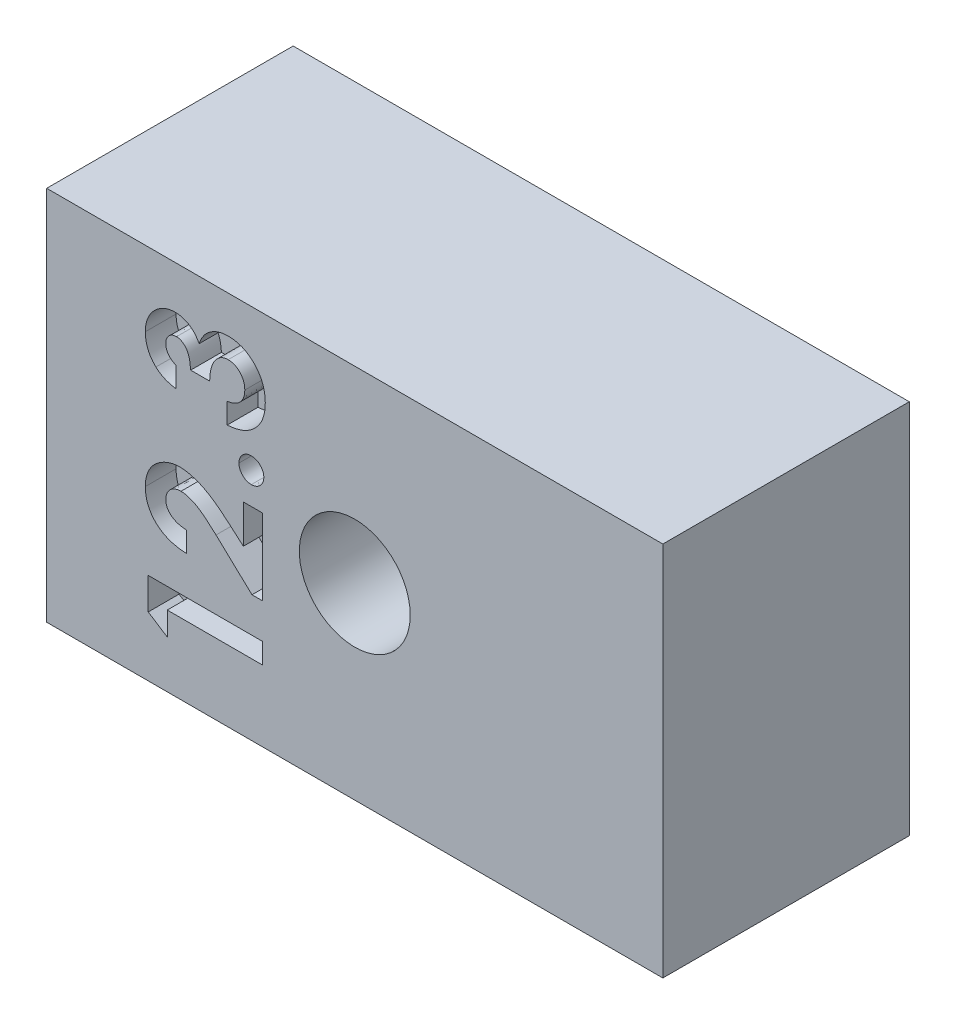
ISO-10303-21;
HEADER;
FILE_DESCRIPTION(('STEP AP214'),'2;1');
FILE_NAME('part.step','',(''),(''),'','','');
FILE_SCHEMA(('AUTOMOTIVE_DESIGN { 1 0 10303 214 1 1 1 1 }'));
ENDSEC;
DATA;
#1=APPLICATION_CONTEXT('core data for automotive mechanical design processes');
#2=APPLICATION_PROTOCOL_DEFINITION('international standard','automotive_design',2000,#1);
#3=PRODUCT_CONTEXT('',#1,'mechanical');
#4=PRODUCT('Part','Part','',(#3));
#5=PRODUCT_RELATED_PRODUCT_CATEGORY('part','',(#4));
#6=PRODUCT_DEFINITION_FORMATION('','',#4);
#7=PRODUCT_DEFINITION_CONTEXT('part definition',#1,'design');
#8=PRODUCT_DEFINITION('design','',#6,#7);
#9=PRODUCT_DEFINITION_SHAPE('','',#8);
#10=(LENGTH_UNIT() NAMED_UNIT(*) SI_UNIT(.MILLI.,.METRE.));
#11=(NAMED_UNIT(*) PLANE_ANGLE_UNIT() SI_UNIT($,.RADIAN.));
#12=(NAMED_UNIT(*) SI_UNIT($,.STERADIAN.) SOLID_ANGLE_UNIT());
#13=UNCERTAINTY_MEASURE_WITH_UNIT(LENGTH_MEASURE(1.E-05),#10,'distance_accuracy_value','');
#14=(GEOMETRIC_REPRESENTATION_CONTEXT(3) GLOBAL_UNCERTAINTY_ASSIGNED_CONTEXT((#13)) GLOBAL_UNIT_ASSIGNED_CONTEXT((#10,
#11,#12)) REPRESENTATION_CONTEXT('',''));
#15=CARTESIAN_POINT('',(0.,0.,0.));
#16=DIRECTION('',(0.,0.,1.));
#17=DIRECTION('',(1.,0.,0.));
#18=AXIS2_PLACEMENT_3D('',#15,#16,#17);
#19=CARTESIAN_POINT('',(0.,0.,8.));
#20=DIRECTION('',(0.,0.,1.));
#21=DIRECTION('',(1.,0.,0.));
#22=AXIS2_PLACEMENT_3D('',#19,#20,#21);
#23=PLANE('',#22);
#24=DIRECTION('',(0.,-1.,0.));
#25=VECTOR('',#24,1.);
#26=CARTESIAN_POINT('',(-12.2454183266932,6.52908366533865,8.));
#27=LINE('',#26,#25);
#28=CARTESIAN_POINT('',(-12.2454183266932,6.52908366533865,8.));
#29=VERTEX_POINT('',#28);
#30=CARTESIAN_POINT('',(-12.2454183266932,-5.67091633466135,8.));
#31=VERTEX_POINT('',#30);
#32=EDGE_CURVE('E584',#29,#31,#27,.T.);
#33=ORIENTED_EDGE('',*,*,#32,.T.);
#34=DIRECTION('',(1.,0.,0.));
#35=VECTOR('',#34,1.);
#36=CARTESIAN_POINT('',(-12.2454183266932,-5.67091633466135,8.));
#37=LINE('',#36,#35);
#38=CARTESIAN_POINT('',(7.75458167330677,-5.67091633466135,8.));
#39=VERTEX_POINT('',#38);
#40=EDGE_CURVE('E587',#31,#39,#37,.T.);
#41=ORIENTED_EDGE('',*,*,#40,.T.);
#42=DIRECTION('',(0.,1.,0.));
#43=VECTOR('',#42,1.);
#44=CARTESIAN_POINT('',(7.75458167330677,6.52908366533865,8.));
#45=LINE('',#44,#43);
#46=CARTESIAN_POINT('',(7.75458167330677,6.52908366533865,8.));
#47=VERTEX_POINT('',#46);
#48=EDGE_CURVE('E590',#39,#47,#45,.T.);
#49=ORIENTED_EDGE('',*,*,#48,.T.);
#50=DIRECTION('',(-1.,0.,0.));
#51=VECTOR('',#50,1.);
#52=CARTESIAN_POINT('',(-12.2454183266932,6.52908366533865,8.));
#53=LINE('',#52,#51);
#54=EDGE_CURVE('E592',#47,#29,#53,.T.);
#55=ORIENTED_EDGE('',*,*,#54,.T.);
#56=EDGE_LOOP('',(#33,#41,#49,#55));
#57=FACE_BOUND('',#56,.T.);
#58=CARTESIAN_POINT('',(-2.24541832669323,0.429083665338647,8.));
#59=DIRECTION('',(0.,0.,1.));
#60=DIRECTION('',(1.,0.,0.));
#61=AXIS2_PLACEMENT_3D('',#58,#59,#60);
#62=CIRCLE('',#61,1.8);
#63=CARTESIAN_POINT('',(-0.44541832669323,0.429083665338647,8.));
#64=VERTEX_POINT('',#63);
#65=EDGE_CURVE('E578',#64,#64,#62,.T.);
#66=ORIENTED_EDGE('',*,*,#65,.F.);
#67=EDGE_LOOP('',(#66));
#68=FACE_BOUND('',#67,.T.);
#69=DIRECTION('',(0.,-1.,0.));
#70=VECTOR('',#69,1.);
#71=CARTESIAN_POINT('',(-8.33222388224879,-3.37006163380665,8.));
#72=LINE('',#71,#70);
#73=CARTESIAN_POINT('',(-8.33222388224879,-3.37006163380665,8.));
#74=VERTEX_POINT('',#73);
#75=CARTESIAN_POINT('',(-8.33222388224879,-4.12989069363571,8.));
#76=VERTEX_POINT('',#75);
#77=EDGE_CURVE('E540',#74,#76,#72,.T.);
#78=ORIENTED_EDGE('',*,*,#77,.T.);
#79=DIRECTION('',(-0.841112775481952,0.540859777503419,0.));
#80=VECTOR('',#79,1.);
#81=CARTESIAN_POINT('',(-8.33222388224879,-4.12989069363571,8.));
#82=LINE('',#81,#80);
#83=CARTESIAN_POINT('',(-8.9495849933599,-3.73290969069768,8.));
#84=VERTEX_POINT('',#83);
#85=EDGE_CURVE('E331',#76,#84,#82,.T.);
#86=ORIENTED_EDGE('',*,*,#85,.T.);
#87=DIRECTION('',(0.,1.,0.));
#88=VECTOR('',#87,1.);
#89=CARTESIAN_POINT('',(-8.9495849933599,-3.73290969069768,8.));
#90=LINE('',#89,#88);
#91=CARTESIAN_POINT('',(-8.9495849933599,-2.70521120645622,8.));
#92=VERTEX_POINT('',#91);
#93=EDGE_CURVE('E335',#84,#92,#90,.T.);
#94=ORIENTED_EDGE('',*,*,#93,.T.);
#95=DIRECTION('',(1.,0.,0.));
#96=VECTOR('',#95,1.);
#97=CARTESIAN_POINT('',(-8.9495849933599,-2.70521120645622,8.));
#98=LINE('',#97,#96);
#99=CARTESIAN_POINT('',(-5.24541832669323,-2.70521120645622,8.));
#100=VERTEX_POINT('',#99);
#101=EDGE_CURVE('E553',#92,#100,#98,.T.);
#102=ORIENTED_EDGE('',*,*,#101,.T.);
#103=DIRECTION('',(0.,-1.,0.));
#104=VECTOR('',#103,1.);
#105=CARTESIAN_POINT('',(-5.24541832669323,-2.70521120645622,8.));
#106=LINE('',#105,#104);
#107=CARTESIAN_POINT('',(-5.24541832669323,-3.37006163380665,8.));
#108=VERTEX_POINT('',#107);
#109=EDGE_CURVE('E556',#100,#108,#106,.T.);
#110=ORIENTED_EDGE('',*,*,#109,.T.);
#111=DIRECTION('',(-1.,0.,0.));
#112=VECTOR('',#111,1.);
#113=CARTESIAN_POINT('',(-5.24541832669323,-3.37006163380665,8.));
#114=LINE('',#113,#112);
#115=EDGE_CURVE('E559',#108,#74,#114,.T.);
#116=ORIENTED_EDGE('',*,*,#115,.T.);
#117=EDGE_LOOP('',(#78,#86,#94,#102,#110,#116));
#118=FACE_BOUND('',#117,.T.);
#119=CARTESIAN_POINT('',(-8.03096353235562,4.46567554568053,8.));
#120=CARTESIAN_POINT('',(-8.05508474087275,4.4643983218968,8.));
#121=CARTESIAN_POINT('',(-8.10216423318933,4.46190545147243,8.));
#122=CARTESIAN_POINT('',(-8.16966507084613,4.44216474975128,8.));
#123=CARTESIAN_POINT('',(-8.23015532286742,4.40866396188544,8.));
#124=CARTESIAN_POINT('',(-8.2829583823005,4.36320873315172,8.));
#125=CARTESIAN_POINT('',(-8.32603052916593,4.30736649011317,8.));
#126=CARTESIAN_POINT('',(-8.3580651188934,4.24273926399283,8.));
#127=CARTESIAN_POINT('',(-8.37675291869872,4.16965453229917,8.));
#128=CARTESIAN_POINT('',(-8.3787040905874,4.11827148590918,8.));
#129=CARTESIAN_POINT('',(-8.3797131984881,4.09169718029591,8.));
#130=B_SPLINE_CURVE_WITH_KNOTS('',3,(#119,#120,#121,#122,#123,#124,#125,#126,#127,#128,#129),
.UNSPECIFIED.,.F.,.F.,(4,1,1,1,1,1,1,1,4),(0.,0.126165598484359,0.246248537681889,
0.364494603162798,0.485724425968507,0.60851457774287,0.731304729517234,0.861036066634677,1.),.UNSPECIFIED.);
#131=CARTESIAN_POINT('',(-8.03096353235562,4.46567554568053,8.));
#132=VERTEX_POINT('',#131);
#133=CARTESIAN_POINT('',(-8.3797131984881,4.09169718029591,8.));
#134=VERTEX_POINT('',#133);
#135=EDGE_CURVE('E491',#132,#134,#130,.T.);
#136=ORIENTED_EDGE('',*,*,#135,.T.);
#137=CARTESIAN_POINT('',(-8.3797131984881,4.09169718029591,8.));
#138=CARTESIAN_POINT('',(-8.37852746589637,4.06760770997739,8.));
#139=CARTESIAN_POINT('',(-8.37617460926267,4.01980682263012,8.));
#140=CARTESIAN_POINT('',(-8.3586135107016,3.94990761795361,8.));
#141=CARTESIAN_POINT('',(-8.32905158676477,3.88352666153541,8.));
#142=CARTESIAN_POINT('',(-8.28828743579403,3.82203851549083,8.));
#143=CARTESIAN_POINT('',(-8.2393314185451,3.76633077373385,8.));
#144=CARTESIAN_POINT('',(-8.18135317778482,3.72061079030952,8.));
#145=CARTESIAN_POINT('',(-8.11782629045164,3.68258307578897,8.));
#146=CARTESIAN_POINT('',(-8.07089292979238,3.66646412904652,8.));
#147=CARTESIAN_POINT('',(-8.04728798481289,3.65835716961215,8.));
#148=B_SPLINE_CURVE_WITH_KNOTS('',3,(#137,#138,#139,#140,#141,#142,#143,#144,#145,#146,#147),
.UNSPECIFIED.,.F.,.F.,(4,1,1,1,1,1,1,1,4),(0.,0.123522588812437,0.245106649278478,
0.367265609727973,0.494690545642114,0.62232387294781,0.746002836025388,0.872253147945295,1.),.UNSPECIFIED.);
#149=CARTESIAN_POINT('',(-8.04728798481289,3.65835716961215,8.));
#150=VERTEX_POINT('',#149);
#151=EDGE_CURVE('E386',#134,#150,#148,.T.);
#152=ORIENTED_EDGE('',*,*,#151,.T.);
#153=DIRECTION('',(0.,-1.,0.));
#154=VECTOR('',#153,1.);
#155=CARTESIAN_POINT('',(-8.04728798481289,3.65835716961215,8.));
#156=LINE('',#155,#154);
#157=CARTESIAN_POINT('',(-8.04728798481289,2.99350674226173,8.));
#158=VERTEX_POINT('',#157);
#159=EDGE_CURVE('E394',#150,#158,#156,.T.);
#160=ORIENTED_EDGE('',*,*,#159,.T.);
#161=CARTESIAN_POINT('',(-8.04728798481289,2.99350674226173,8.));
#162=CARTESIAN_POINT('',(-8.08052875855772,2.99817155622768,8.));
#163=CARTESIAN_POINT('',(-8.14545621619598,3.00728309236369,8.));
#164=CARTESIAN_POINT('',(-8.23967986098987,3.02968175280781,8.));
#165=CARTESIAN_POINT('',(-8.32927959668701,3.05558444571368,8.));
#166=CARTESIAN_POINT('',(-8.41377456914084,3.08871032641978,8.));
#167=CARTESIAN_POINT('',(-8.49307369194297,3.1269481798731,8.));
#168=CARTESIAN_POINT('',(-8.56724792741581,3.1715387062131,8.));
#169=CARTESIAN_POINT('',(-8.63736173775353,3.22041287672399,8.));
#170=CARTESIAN_POINT('',(-8.67937877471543,3.25867829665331,8.));
#171=CARTESIAN_POINT('',(-8.70026608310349,3.27770061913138,8.));
#172=B_SPLINE_CURVE_WITH_KNOTS('',3,(#161,#162,#163,#164,#165,#166,#167,#168,#169,#170,#171),
.UNSPECIFIED.,.F.,.F.,(4,1,1,1,1,1,1,1,4),(0.,0.138943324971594,0.27139069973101,
0.400711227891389,0.524932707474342,0.646800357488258,0.764858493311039,0.88310757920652,1.),.UNSPECIFIED.);
#173=CARTESIAN_POINT('',(-8.70026608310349,3.27770061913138,8.));
#174=VERTEX_POINT('',#173);
#175=EDGE_CURVE('E400',#158,#174,#172,.T.);
#176=ORIENTED_EDGE('',*,*,#175,.T.);
#177=CARTESIAN_POINT('',(-8.70026608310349,3.27770061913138,8.));
#178=CARTESIAN_POINT('',(-8.72786797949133,3.30507013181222,8.));
#179=CARTESIAN_POINT('',(-8.78226841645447,3.35901256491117,8.));
#180=CARTESIAN_POINT('',(-8.85194936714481,3.44915669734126,8.));
#181=CARTESIAN_POINT('',(-8.91225349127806,3.54364439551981,8.));
#182=CARTESIAN_POINT('',(-8.96006303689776,3.64437065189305,8.));
#183=CARTESIAN_POINT('',(-8.99875932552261,3.74976808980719,8.));
#184=CARTESIAN_POINT('',(-9.02475171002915,3.8606748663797,8.));
#185=CARTESIAN_POINT('',(-9.04199788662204,3.976637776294,8.));
#186=CARTESIAN_POINT('',(-9.04369669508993,4.05576787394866,8.));
#187=CARTESIAN_POINT('',(-9.04456362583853,4.09614930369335,8.));
#188=B_SPLINE_CURVE_WITH_KNOTS('',3,(#177,#178,#179,#180,#181,#182,#183,#184,#185,#186,#187),
.UNSPECIFIED.,.F.,.F.,(4,1,1,1,1,1,1,1,4),(0.,0.127406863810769,0.251105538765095,
0.372907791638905,0.494496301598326,0.616171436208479,0.740562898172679,0.867604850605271,1.),.UNSPECIFIED.);
#189=CARTESIAN_POINT('',(-9.04456362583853,4.09614930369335,8.));
#190=VERTEX_POINT('',#189);
#191=EDGE_CURVE('E405',#174,#190,#188,.T.);
#192=ORIENTED_EDGE('',*,*,#191,.T.);
#193=CARTESIAN_POINT('',(-9.04456362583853,4.09614930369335,8.));
#194=CARTESIAN_POINT('',(-9.04371606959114,4.1320504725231,8.));
#195=CARTESIAN_POINT('',(-9.04204994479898,4.20262493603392,8.));
#196=CARTESIAN_POINT('',(-9.02867519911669,4.30635163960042,8.));
#197=CARTESIAN_POINT('',(-9.00521738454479,4.40524637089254,8.));
#198=CARTESIAN_POINT('',(-8.97454681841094,4.50035447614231,8.));
#199=CARTESIAN_POINT('',(-8.93281438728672,4.59027722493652,8.));
#200=CARTESIAN_POINT('',(-8.88437191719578,4.67699929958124,8.));
#201=CARTESIAN_POINT('',(-8.82495521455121,4.75809768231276,8.));
#202=CARTESIAN_POINT('',(-8.75782032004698,4.83376212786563,8.));
#203=CARTESIAN_POINT('',(-8.68520735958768,4.90327435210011,8.));
#204=CARTESIAN_POINT('',(-8.60759007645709,4.96347224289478,8.));
#205=CARTESIAN_POINT('',(-8.527041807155,5.01522544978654,8.));
#206=CARTESIAN_POINT('',(-8.44289334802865,5.05786324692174,8.));
#207=CARTESIAN_POINT('',(-8.35500230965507,5.09064591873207,8.));
#208=CARTESIAN_POINT('',(-8.26387642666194,5.11339806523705,8.));
#209=CARTESIAN_POINT('',(-8.16971677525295,5.12828989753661,8.));
#210=CARTESIAN_POINT('',(-8.10571772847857,5.12977351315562,8.));
#211=CARTESIAN_POINT('',(-8.07325870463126,5.13052597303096,8.));
#212=B_SPLINE_CURVE_WITH_KNOTS('',3,(#193,#194,#195,#196,#197,#198,#199,#200,#201,#202,#203,
#204,#205,#206,#207,#208,#209,#210,#211),.UNSPECIFIED.,.F.,.F.,(4,1,1,1,1,1,1,1,1,1,1,1,1,1,1,1,
4),(0.,0.068213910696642,0.13409480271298,0.198285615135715,0.26116018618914,0.323634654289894,
0.386366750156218,0.449642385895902,0.514244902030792,0.578413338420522,0.640374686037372,
0.700614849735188,0.760103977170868,0.819298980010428,0.878465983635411,0.938360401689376,1.),.UNSPECIFIED.);
#213=CARTESIAN_POINT('',(-8.07325870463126,5.13052597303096,8.));
#214=VERTEX_POINT('',#213);
#215=EDGE_CURVE('E413',#190,#214,#212,.T.);
#216=ORIENTED_EDGE('',*,*,#215,.T.);
#217=CARTESIAN_POINT('',(-8.07325870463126,5.13052597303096,8.));
#218=CARTESIAN_POINT('',(-8.03306804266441,5.12895214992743,8.));
#219=CARTESIAN_POINT('',(-7.95370260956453,5.12584428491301,8.));
#220=CARTESIAN_POINT('',(-7.83777394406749,5.10126563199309,8.));
#221=CARTESIAN_POINT('',(-7.7271772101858,5.06175404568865,8.));
#222=CARTESIAN_POINT('',(-7.62322282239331,5.00557442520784,8.));
#223=CARTESIAN_POINT('',(-7.52601906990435,4.93502509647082,8.));
#224=CARTESIAN_POINT('',(-7.43896084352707,4.84850971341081,8.));
#225=CARTESIAN_POINT('',(-7.36069989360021,4.74844257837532,8.));
#226=CARTESIAN_POINT('',(-7.31864192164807,4.67332293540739,8.));
#227=CARTESIAN_POINT('',(-7.29710519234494,4.63485623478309,8.));
#228=B_SPLINE_CURVE_WITH_KNOTS('',3,(#217,#218,#219,#220,#221,#222,#223,#224,#225,#226,#227),
.UNSPECIFIED.,.F.,.F.,(4,1,1,1,1,1,1,1,4),(0.,0.124097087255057,0.245057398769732,
0.364484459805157,0.485868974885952,0.608926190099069,0.734308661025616,0.863946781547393,1.),.UNSPECIFIED.);
#229=CARTESIAN_POINT('',(-7.29710519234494,4.63485623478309,8.));
#230=VERTEX_POINT('',#229);
#231=EDGE_CURVE('E421',#214,#230,#228,.T.);
#232=ORIENTED_EDGE('',*,*,#231,.T.);
#233=CARTESIAN_POINT('',(-7.29710519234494,4.63485623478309,8.));
#234=CARTESIAN_POINT('',(-7.28843765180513,4.66126017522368,8.));
#235=CARTESIAN_POINT('',(-7.27140632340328,4.71314273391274,8.));
#236=CARTESIAN_POINT('',(-7.23784259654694,4.78687268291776,8.));
#237=CARTESIAN_POINT('',(-7.20124094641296,4.85703914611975,8.));
#238=CARTESIAN_POINT('',(-7.15851243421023,4.92203744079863,8.));
#239=CARTESIAN_POINT('',(-7.11261867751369,4.98364999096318,8.));
#240=CARTESIAN_POINT('',(-7.06109210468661,5.03992745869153,8.));
#241=CARTESIAN_POINT('',(-7.00525532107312,5.09232713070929,8.));
#242=CARTESIAN_POINT('',(-6.94451432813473,5.13955270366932,8.));
#243=CARTESIAN_POINT('',(-6.87987902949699,5.18177455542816,8.));
#244=CARTESIAN_POINT('',(-6.81251114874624,5.21898426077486,8.));
#245=CARTESIAN_POINT('',(-6.74216446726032,5.25021019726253,8.));
#246=CARTESIAN_POINT('',(-6.66935593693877,5.276417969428,8.));
#247=CARTESIAN_POINT('',(-6.5933690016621,5.29641377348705,8.));
#248=CARTESIAN_POINT('',(-6.51446117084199,5.31048154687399,8.));
#249=CARTESIAN_POINT('',(-6.43282257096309,5.31861571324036,8.));
#250=CARTESIAN_POINT('',(-6.37751208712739,5.31985606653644,8.));
#251=CARTESIAN_POINT('',(-6.34954492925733,5.32048323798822,8.));
#252=B_SPLINE_CURVE_WITH_KNOTS('',3,(#233,#234,#235,#236,#237,#238,#239,#240,#241,#242,#243,
#244,#245,#246,#247,#248,#249,#250,#251),.UNSPECIFIED.,.F.,.F.,(4,1,1,1,1,1,1,1,1,1,1,1,1,1,1,1,
4),(0.,0.0662109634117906,0.130101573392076,0.192891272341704,0.254723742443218,
0.315349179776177,0.375885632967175,0.436387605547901,0.49773160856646,0.559069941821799,
0.620303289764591,0.681020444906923,0.742389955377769,0.804614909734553,0.868123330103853,
0.933317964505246,1.),.UNSPECIFIED.);
#253=CARTESIAN_POINT('',(-6.34954492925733,5.32048323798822,8.));
#254=VERTEX_POINT('',#253);
#255=EDGE_CURVE('E429',#230,#254,#252,.T.);
#256=ORIENTED_EDGE('',*,*,#255,.T.);
#257=CARTESIAN_POINT('',(-6.34954492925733,5.32048323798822,8.));
#258=CARTESIAN_POINT('',(-6.30844459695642,5.31921177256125,8.));
#259=CARTESIAN_POINT('',(-6.22740311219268,5.31670470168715,8.));
#260=CARTESIAN_POINT('',(-6.10803752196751,5.30076552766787,8.));
#261=CARTESIAN_POINT('',(-5.99423217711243,5.2710908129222,8.));
#262=CARTESIAN_POINT('',(-5.88468163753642,5.23204826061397,8.));
#263=CARTESIAN_POINT('',(-5.78078511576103,5.17998403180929,8.00000000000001));
#264=CARTESIAN_POINT('',(-5.68021553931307,5.11866064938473,8.));
#265=CARTESIAN_POINT('',(-5.58638348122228,5.04359892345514,8.));
#266=CARTESIAN_POINT('',(-5.49748822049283,4.95942423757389,8.));
#267=CARTESIAN_POINT('',(-5.41627437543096,4.86643140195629,8.));
#268=CARTESIAN_POINT('',(-5.34452104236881,4.76636507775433,8.));
#269=CARTESIAN_POINT('',(-5.28537179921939,4.65903139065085,8.));
#270=CARTESIAN_POINT('',(-5.23481471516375,4.54702525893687,8.));
#271=CARTESIAN_POINT('',(-5.19729340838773,4.42782342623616,8.));
#272=CARTESIAN_POINT('',(-5.1698160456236,4.30296785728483,8.));
#273=CARTESIAN_POINT('',(-5.15309798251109,4.17154680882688,8.));
#274=CARTESIAN_POINT('',(-5.15133835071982,4.08185293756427,8.));
#275=CARTESIAN_POINT('',(-5.1504396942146,4.03604563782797,8.));
#276=B_SPLINE_CURVE_WITH_KNOTS('',3,(#257,#258,#259,#260,#261,#262,#263,#264,#265,#266,#267,
#268,#269,#270,#271,#272,#273,#274,#275),.UNSPECIFIED.,.F.,.F.,(4,1,1,1,1,1,1,1,1,1,1,1,1,1,1,1,
4),(0.,0.0628267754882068,0.123881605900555,0.183570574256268,0.242287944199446,
0.301291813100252,0.360878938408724,0.421986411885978,0.484557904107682,0.547788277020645,
0.610411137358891,0.672354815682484,0.734805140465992,0.797929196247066,0.862961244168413,
0.9300133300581,1.),.UNSPECIFIED.);
#277=CARTESIAN_POINT('',(-5.1504396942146,4.03604563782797,8.));
#278=VERTEX_POINT('',#277);
#279=EDGE_CURVE('E437',#254,#278,#276,.T.);
#280=ORIENTED_EDGE('',*,*,#279,.T.);
#281=CARTESIAN_POINT('',(-5.1504396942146,4.03604563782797,8.));
#282=CARTESIAN_POINT('',(-5.15138500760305,3.99271174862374,8.));
#283=CARTESIAN_POINT('',(-5.15323344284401,3.9079780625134,8.));
#284=CARTESIAN_POINT('',(-5.16923258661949,3.78403731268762,8.));
#285=CARTESIAN_POINT('',(-5.19504050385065,3.66624336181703,8.));
#286=CARTESIAN_POINT('',(-5.23141890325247,3.5542955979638,8.));
#287=CARTESIAN_POINT('',(-5.27859547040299,3.44862713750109,8.));
#288=CARTESIAN_POINT('',(-5.33477217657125,3.34827973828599,8.));
#289=CARTESIAN_POINT('',(-5.40318916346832,3.25525581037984,8.));
#290=CARTESIAN_POINT('',(-5.48075795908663,3.16851888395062,8.));
#291=CARTESIAN_POINT('',(-5.56778574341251,3.08999304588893,8.));
#292=CARTESIAN_POINT('',(-5.66225656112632,3.01980943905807,8.));
#293=CARTESIAN_POINT('',(-5.76452964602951,2.95951562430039,8.));
#294=CARTESIAN_POINT('',(-5.87416804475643,2.90886433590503,8.));
#295=CARTESIAN_POINT('',(-5.99136409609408,2.86825155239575,8.));
#296=CARTESIAN_POINT('',(-6.11587947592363,2.83621630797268,8.));
#297=CARTESIAN_POINT('',(-6.24795744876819,2.8138391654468,8.));
#298=CARTESIAN_POINT('',(-6.33882990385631,2.80702415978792,8.));
#299=CARTESIAN_POINT('',(-6.38516191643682,2.80354947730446,8.));
#300=B_SPLINE_CURVE_WITH_KNOTS('',3,(#281,#282,#283,#284,#285,#286,#287,#288,#289,#290,#291,
#292,#293,#294,#295,#296,#297,#298,#299),.UNSPECIFIED.,.F.,.F.,(4,1,1,1,1,1,1,1,1,1,1,1,1,1,1,1,
4),(0.,0.0666590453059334,0.130342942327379,0.191936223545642,0.251995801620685,
0.311121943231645,0.369754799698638,0.428602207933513,0.488435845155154,0.548524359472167,
0.608661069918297,0.669235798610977,0.730880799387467,0.794196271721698,0.859830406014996,
0.928533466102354,1.),.UNSPECIFIED.);
#301=CARTESIAN_POINT('',(-6.38516191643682,2.80354947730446,8.));
#302=VERTEX_POINT('',#301);
#303=EDGE_CURVE('E445',#278,#302,#300,.T.);
#304=ORIENTED_EDGE('',*,*,#303,.T.);
#305=DIRECTION('',(0.,1.,0.));
#306=VECTOR('',#305,1.);
#307=CARTESIAN_POINT('',(-6.38516191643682,2.80354947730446,8.));
#308=LINE('',#307,#306);
#309=CARTESIAN_POINT('',(-6.38516191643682,3.46839990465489,8.));
#310=VERTEX_POINT('',#309);
#311=EDGE_CURVE('E453',#302,#310,#308,.T.);
#312=ORIENTED_EDGE('',*,*,#311,.T.);
#313=CARTESIAN_POINT('',(-6.38516191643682,3.46839990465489,8.));
#314=CARTESIAN_POINT('',(-6.36186596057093,3.47261381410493,8.));
#315=CARTESIAN_POINT('',(-6.31649097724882,3.48082150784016,8.));
#316=CARTESIAN_POINT('',(-6.25079162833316,3.49681563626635,8.));
#317=CARTESIAN_POINT('',(-6.19017093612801,3.51771303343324,8.));
#318=CARTESIAN_POINT('',(-6.13418353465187,3.54160495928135,8.));
#319=CARTESIAN_POINT('',(-6.08225484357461,3.5680202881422,8.));
#320=CARTESIAN_POINT('',(-6.03577352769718,3.59958202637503,8.));
#321=CARTESIAN_POINT('',(-5.99291286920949,3.63342321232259,8.));
#322=CARTESIAN_POINT('',(-5.94364742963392,3.68429422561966,8.));
#323=CARTESIAN_POINT('',(-5.89198219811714,3.75527094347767,8.));
#324=CARTESIAN_POINT('',(-5.84622510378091,3.8513692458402,8.));
#325=CARTESIAN_POINT('',(-5.82020132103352,3.95875717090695,8.));
#326=CARTESIAN_POINT('',(-5.81696359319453,4.03367972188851,8.));
#327=CARTESIAN_POINT('',(-5.81529012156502,4.07240464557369,8.));
#328=B_SPLINE_CURVE_WITH_KNOTS('',3,(#313,#314,#315,#316,#317,#318,#319,#320,#321,#322,#323,
#324,#325,#326,#327),.UNSPECIFIED.,.F.,.F.,(4,1,1,1,1,1,1,1,1,1,1,1,4),(0.,0.0773708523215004,
0.150700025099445,0.220747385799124,0.286665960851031,0.349581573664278,0.410791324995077,
0.470003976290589,0.527741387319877,0.641738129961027,0.755286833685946,0.873516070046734,1.),.UNSPECIFIED.);
#329=CARTESIAN_POINT('',(-5.81529012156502,4.07240464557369,8.));
#330=VERTEX_POINT('',#329);
#331=EDGE_CURVE('E459',#310,#330,#328,.T.);
#332=ORIENTED_EDGE('',*,*,#331,.T.);
#333=CARTESIAN_POINT('',(-5.81529012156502,4.07240464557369,8.));
#334=CARTESIAN_POINT('',(-5.81564451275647,4.09295630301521,8.));
#335=CARTESIAN_POINT('',(-5.81633868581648,4.13321240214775,8.));
#336=CARTESIAN_POINT('',(-5.82396281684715,4.19235771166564,8.));
#337=CARTESIAN_POINT('',(-5.83666560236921,4.24864422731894,8.));
#338=CARTESIAN_POINT('',(-5.85346035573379,4.30253938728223,8.));
#339=CARTESIAN_POINT('',(-5.87625074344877,4.35319621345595,8.));
#340=CARTESIAN_POINT('',(-5.90269891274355,4.40176166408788,8.));
#341=CARTESIAN_POINT('',(-5.93507547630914,4.44734758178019,8.));
#342=CARTESIAN_POINT('',(-5.97196549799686,4.48968841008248,8.));
#343=CARTESIAN_POINT('',(-6.01135724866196,4.52909358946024,8.));
#344=CARTESIAN_POINT('',(-6.05446214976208,4.56274104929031,8.));
#345=CARTESIAN_POINT('',(-6.0992104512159,4.59179058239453,8.));
#346=CARTESIAN_POINT('',(-6.1467857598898,4.6147126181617,8.));
#347=CARTESIAN_POINT('',(-6.19568620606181,4.63389694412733,8.));
#348=CARTESIAN_POINT('',(-6.24746605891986,4.64586191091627,8.));
#349=CARTESIAN_POINT('',(-6.30100136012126,4.65484181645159,8.));
#350=CARTESIAN_POINT('',(-6.3376322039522,4.65536651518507,8.));
#351=CARTESIAN_POINT('',(-6.35622311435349,4.65563281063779,8.));
#352=B_SPLINE_CURVE_WITH_KNOTS('',3,(#333,#334,#335,#336,#337,#338,#339,#340,#341,#342,#343,
#344,#345,#346,#347,#348,#349,#350,#351),.UNSPECIFIED.,.F.,.F.,(4,1,1,1,1,1,1,1,1,1,1,1,1,1,1,1,
4),(0.,0.0694189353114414,0.135976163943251,0.201068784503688,0.264244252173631,
0.32636593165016,0.388470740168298,0.450850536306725,0.5148554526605,0.578097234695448,
0.638796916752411,0.699312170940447,0.757998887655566,0.816988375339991,0.876385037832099,
0.937262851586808,1.),.UNSPECIFIED.);
#353=CARTESIAN_POINT('',(-6.35622311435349,4.65563281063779,8.));
#354=VERTEX_POINT('',#353);
#355=EDGE_CURVE('E464',#330,#354,#352,.T.);
#356=ORIENTED_EDGE('',*,*,#355,.T.);
#357=CARTESIAN_POINT('',(-6.35622311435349,4.65563281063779,8.));
#358=CARTESIAN_POINT('',(-6.37656205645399,4.65495562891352,8.));
#359=CARTESIAN_POINT('',(-6.41680894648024,4.65361561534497,8.));
#360=CARTESIAN_POINT('',(-6.47578883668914,4.64182356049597,8.));
#361=CARTESIAN_POINT('',(-6.53274243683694,4.62417259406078,8.));
#362=CARTESIAN_POINT('',(-6.58719983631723,4.59878722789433,8.));
#363=CARTESIAN_POINT('',(-6.63884076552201,4.56556934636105,8.));
#364=CARTESIAN_POINT('',(-6.68809291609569,4.52517980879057,8.));
#365=CARTESIAN_POINT('',(-6.73456416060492,4.47725324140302,8.));
#366=CARTESIAN_POINT('',(-6.77960792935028,4.42339457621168,8.));
#367=CARTESIAN_POINT('',(-6.81903903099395,4.36143071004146,8.));
#368=CARTESIAN_POINT('',(-6.85534917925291,4.29386384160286,8.));
#369=CARTESIAN_POINT('',(-6.88426100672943,4.21902940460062,8.));
#370=CARTESIAN_POINT('',(-6.91007831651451,4.13872268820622,8.));
#371=CARTESIAN_POINT('',(-6.92893645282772,4.05143373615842,8.));
#372=CARTESIAN_POINT('',(-6.94262884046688,3.95770194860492,8.));
#373=CARTESIAN_POINT('',(-6.95282083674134,3.85767929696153,8.));
#374=CARTESIAN_POINT('',(-6.95428303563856,3.78873235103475,8.));
#375=CARTESIAN_POINT('',(-6.95503371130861,3.75333580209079,8.));
#376=B_SPLINE_CURVE_WITH_KNOTS('',3,(#357,#358,#359,#360,#361,#362,#363,#364,#365,#366,#367,
#368,#369,#370,#371,#372,#373,#374,#375),.UNSPECIFIED.,.F.,.F.,(4,1,1,1,1,1,1,1,1,1,1,1,1,1,1,1,
4),(0.,0.050616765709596,0.100160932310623,0.149266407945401,0.198883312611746,
0.249304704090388,0.301846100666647,0.357178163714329,0.415398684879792,0.476408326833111,
0.539798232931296,0.606157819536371,0.675919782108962,0.749765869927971,0.828276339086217,
0.911839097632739,1.),.UNSPECIFIED.);
#377=CARTESIAN_POINT('',(-6.95503371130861,3.75333580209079,8.));
#378=VERTEX_POINT('',#377);
#379=EDGE_CURVE('E472',#354,#378,#376,.T.);
#380=ORIENTED_EDGE('',*,*,#379,.T.);
#381=DIRECTION('',(-1.,0.,0.));
#382=VECTOR('',#381,1.);
#383=CARTESIAN_POINT('',(-6.95503371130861,3.75333580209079,8.));
#384=LINE('',#383,#382);
#385=CARTESIAN_POINT('',(-7.57239482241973,3.75333580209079,8.));
#386=VERTEX_POINT('',#385);
#387=EDGE_CURVE('E480',#378,#386,#384,.T.);
#388=ORIENTED_EDGE('',*,*,#387,.T.);
#389=CARTESIAN_POINT('',(-7.57239482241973,3.75333580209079,8.));
#390=CARTESIAN_POINT('',(-7.57613400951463,3.79741198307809,8.));
#391=CARTESIAN_POINT('',(-7.58312928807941,3.87986978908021,8.));
#392=CARTESIAN_POINT('',(-7.59971826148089,3.9942469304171,8.));
#393=CARTESIAN_POINT('',(-7.621178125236,4.09086559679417,8.));
#394=CARTESIAN_POINT('',(-7.64914614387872,4.17083016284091,8.));
#395=CARTESIAN_POINT('',(-7.68181480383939,4.23832710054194,8.));
#396=CARTESIAN_POINT('',(-7.71966692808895,4.296464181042,8.));
#397=CARTESIAN_POINT('',(-7.76313300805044,4.34718704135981,8.));
#398=CARTESIAN_POINT('',(-7.81214971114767,4.38890871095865,8.));
#399=CARTESIAN_POINT('',(-7.86352921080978,4.42367758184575,8.));
#400=CARTESIAN_POINT('',(-7.91817399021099,4.44747870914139,8.));
#401=CARTESIAN_POINT('',(-7.97390989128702,4.46343191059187,8.));
#402=CARTESIAN_POINT('',(-8.01206007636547,4.46493216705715,8.));
#403=CARTESIAN_POINT('',(-8.03096353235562,4.46567554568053,8.));
#404=B_SPLINE_CURVE_WITH_KNOTS('',3,(#389,#390,#391,#392,#393,#394,#395,#396,#397,#398,#399,
#400,#401,#402,#403),.UNSPECIFIED.,.F.,.F.,(4,1,1,1,1,1,1,1,1,1,1,1,4),(0.,0.14172599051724,
0.265141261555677,0.370116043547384,0.458355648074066,0.535986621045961,0.609852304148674,
0.680090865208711,0.749211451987,0.81560144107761,0.878051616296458,0.939574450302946,1.),.UNSPECIFIED.);
#405=EDGE_CURVE('E486',#386,#132,#404,.T.);
#406=ORIENTED_EDGE('',*,*,#405,.T.);
#407=EDGE_LOOP('',(#136,#152,#160,#176,#192,#216,#232,#256,#280,#304,#312,#332,#356,#380,#388,#406));
#408=FACE_BOUND('',#407,.T.);
#409=CARTESIAN_POINT('',(-5.19792901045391,1.92499712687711,8.));
#410=CARTESIAN_POINT('',(-5.19930702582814,1.89812613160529,8.));
#411=CARTESIAN_POINT('',(-5.20202366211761,1.84515232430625,8.));
#412=CARTESIAN_POINT('',(-5.22509639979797,1.7689860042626,8.));
#413=CARTESIAN_POINT('',(-5.2631397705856,1.69916571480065,8.));
#414=CARTESIAN_POINT('',(-5.31506188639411,1.63775740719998,8.));
#415=CARTESIAN_POINT('',(-5.3763018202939,1.58566395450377,8.));
#416=CARTESIAN_POINT('',(-5.44653763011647,1.54867227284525,8.));
#417=CARTESIAN_POINT('',(-5.52269649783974,1.52530589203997,8.));
#418=CARTESIAN_POINT('',(-5.57594187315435,1.52267729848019,8.));
#419=CARTESIAN_POINT('',(-5.60307223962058,1.52133793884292,8.));
#420=B_SPLINE_CURVE_WITH_KNOTS('',3,(#409,#410,#411,#412,#413,#414,#415,#416,#417,#418,#419),
.UNSPECIFIED.,.F.,.F.,(4,1,1,1,1,1,1,1,4),(0.,0.126667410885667,0.249713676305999,
0.371998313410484,0.499695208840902,0.627392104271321,0.749123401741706,0.872169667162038,1.),.UNSPECIFIED.);
#421=CARTESIAN_POINT('',(-5.19792901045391,1.92499712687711,8.));
#422=VERTEX_POINT('',#421);
#423=CARTESIAN_POINT('',(-5.60307223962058,1.52133793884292,8.));
#424=VERTEX_POINT('',#423);
#425=EDGE_CURVE('E348',#422,#424,#420,.T.);
#426=ORIENTED_EDGE('',*,*,#425,.T.);
#427=CARTESIAN_POINT('',(-5.60307223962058,1.52133793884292,8.));
#428=CARTESIAN_POINT('',(-5.63021307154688,1.5226445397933,8.));
#429=CARTESIAN_POINT('',(-5.68324138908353,1.52519740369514,8.));
#430=CARTESIAN_POINT('',(-5.75903666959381,1.54886986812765,8.));
#431=CARTESIAN_POINT('',(-5.82902323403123,1.58544878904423,8.));
#432=CARTESIAN_POINT('',(-5.88960045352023,1.63782479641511,8.));
#433=CARTESIAN_POINT('',(-5.94088562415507,1.69918095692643,8.));
#434=CARTESIAN_POINT('',(-5.97794248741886,1.76918569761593,8.00000000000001));
#435=CARTESIAN_POINT('',(-6.00119736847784,1.84512988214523,8.));
#436=CARTESIAN_POINT('',(-6.00388439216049,1.89811857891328,8.));
#437=CARTESIAN_POINT('',(-6.00524738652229,1.92499712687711,8.));
#438=B_SPLINE_CURVE_WITH_KNOTS('',3,(#427,#428,#429,#430,#431,#432,#433,#434,#435,#436,#437),
.UNSPECIFIED.,.F.,.F.,(4,1,1,1,1,1,1,1,4),(0.,0.128255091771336,0.250587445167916,
0.372723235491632,0.499946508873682,0.627320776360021,0.749456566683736,0.872911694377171,1.),.UNSPECIFIED.);
#439=CARTESIAN_POINT('',(-6.00524738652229,1.92499712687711,8.));
#440=VERTEX_POINT('',#439);
#441=EDGE_CURVE('E56',#424,#440,#438,.T.);
#442=ORIENTED_EDGE('',*,*,#441,.T.);
#443=CARTESIAN_POINT('',(-6.00524738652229,1.92499712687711,8.));
#444=CARTESIAN_POINT('',(-6.00387317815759,1.95186946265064,8.));
#445=CARTESIAN_POINT('',(-6.00116404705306,2.00484591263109,8.));
#446=CARTESIAN_POINT('',(-5.97813477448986,2.0806688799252,8.));
#447=CARTESIAN_POINT('',(-5.94063064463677,2.15016824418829,8.));
#448=CARTESIAN_POINT('',(-5.88966283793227,2.21150441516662,8.));
#449=CARTESIAN_POINT('',(-5.82880407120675,2.26365036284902,8.));
#450=CARTESIAN_POINT('',(-5.75926032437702,2.30129181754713,8.));
#451=CARTESIAN_POINT('',(-5.68321216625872,2.32474337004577,8.));
#452=CARTESIAN_POINT('',(-5.6302031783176,2.32733160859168,8.));
#453=CARTESIAN_POINT('',(-5.60307223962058,2.3286563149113,8.));
#454=B_SPLINE_CURVE_WITH_KNOTS('',3,(#443,#444,#445,#446,#447,#448,#449,#450,#451,#452,#453),
.UNSPECIFIED.,.F.,.F.,(4,1,1,1,1,1,1,1,4),(0.,0.127149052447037,0.25066319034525,
0.371823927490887,0.499259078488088,0.626543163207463,0.749292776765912,0.8716836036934,1.),.UNSPECIFIED.);
#455=CARTESIAN_POINT('',(-5.60307223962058,2.3286563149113,8.));
#456=VERTEX_POINT('',#455);
#457=EDGE_CURVE('E899',#440,#456,#454,.T.);
#458=ORIENTED_EDGE('',*,*,#457,.T.);
#459=CARTESIAN_POINT('',(-5.60307223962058,2.3286563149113,8.));
#460=CARTESIAN_POINT('',(-5.57595175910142,2.32729886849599,8.));
#461=CARTESIAN_POINT('',(-5.52272578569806,2.32463477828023,8.));
#462=CARTESIAN_POINT('',(-5.44631276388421,2.30149176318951,8.));
#463=CARTESIAN_POINT('',(-5.37652226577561,2.2634330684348,8.));
#464=CARTESIAN_POINT('',(-5.31499873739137,2.21157286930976,8.));
#465=CARTESIAN_POINT('',(-5.26339682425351,2.15017964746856,8.));
#466=CARTESIAN_POINT('',(-5.22490378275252,2.08087114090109,8.));
#467=CARTESIAN_POINT('',(-5.20205723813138,2.00482300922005,8.));
#468=CARTESIAN_POINT('',(-5.1993183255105,1.9518617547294,8.));
#469=CARTESIAN_POINT('',(-5.19792901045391,1.92499712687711,8.));
#470=B_SPLINE_CURVE_WITH_KNOTS('',3,(#459,#460,#461,#462,#463,#464,#465,#466,#467,#468,#469),
.UNSPECIFIED.,.F.,.F.,(4,1,1,1,1,1,1,1,4),(0.,0.12789063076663,0.250994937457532,
0.37333725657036,0.501094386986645,0.62885151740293,0.75016853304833,0.873272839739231,1.),.UNSPECIFIED.);
#471=EDGE_CURVE('E907',#456,#422,#470,.T.);
#472=ORIENTED_EDGE('',*,*,#471,.T.);
#473=EDGE_LOOP('',(#426,#442,#458,#472));
#474=FACE_BOUND('',#473,.T.);
#475=CARTESIAN_POINT('',(-7.8870115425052,0.191637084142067,8.));
#476=CARTESIAN_POINT('',(-7.92134239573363,0.190349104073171,8.));
#477=CARTESIAN_POINT('',(-7.9878639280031,0.187853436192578,8.));
#478=CARTESIAN_POINT('',(-8.08249045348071,0.160428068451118,8.));
#479=CARTESIAN_POINT('',(-8.16816511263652,0.117939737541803,8.));
#480=CARTESIAN_POINT('',(-8.24232785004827,0.0580676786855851,8.));
#481=CARTESIAN_POINT('',(-8.30327228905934,-0.0144561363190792,8.));
#482=CARTESIAN_POINT('',(-8.3486010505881,-0.0982642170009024,8.));
#483=CARTESIAN_POINT('',(-8.37475553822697,-0.192673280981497,8.));
#484=CARTESIAN_POINT('',(-8.37802914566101,-0.258855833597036,8.));
#485=CARTESIAN_POINT('',(-8.3797131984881,-0.292902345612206,8.));
#486=B_SPLINE_CURVE_WITH_KNOTS('',3,(#475,#476,#477,#478,#479,#480,#481,#482,#483,#484,#485),
.UNSPECIFIED.,.F.,.F.,(4,1,1,1,1,1,1,1,4),(0.,0.132754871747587,0.257233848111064,
0.378600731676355,0.501406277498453,0.623941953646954,0.743641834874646,0.868120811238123,1.),.UNSPECIFIED.);
#487=CARTESIAN_POINT('',(-7.8870115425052,0.191637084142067,8.));
#488=VERTEX_POINT('',#487);
#489=CARTESIAN_POINT('',(-8.3797131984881,-0.292902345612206,8.));
#490=VERTEX_POINT('',#489);
#491=EDGE_CURVE('E326',#488,#490,#486,.T.);
#492=ORIENTED_EDGE('',*,*,#491,.T.);
#493=CARTESIAN_POINT('',(-8.3797131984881,-0.292902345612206,8.));
#494=CARTESIAN_POINT('',(-8.37909108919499,-0.310491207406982,8.));
#495=CARTESIAN_POINT('',(-8.37786636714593,-0.345117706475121,8.));
#496=CARTESIAN_POINT('',(-8.36971372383,-0.396015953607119,8.));
#497=CARTESIAN_POINT('',(-8.35534554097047,-0.44444929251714,8.));
#498=CARTESIAN_POINT('',(-8.3360941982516,-0.49095681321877,8.));
#499=CARTESIAN_POINT('',(-8.31057640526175,-0.535042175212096,8.));
#500=CARTESIAN_POINT('',(-8.27912165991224,-0.57659418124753,8.));
#501=CARTESIAN_POINT('',(-8.24252929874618,-0.616050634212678,8.));
#502=CARTESIAN_POINT('',(-8.20091374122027,-0.653230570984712,8.));
#503=CARTESIAN_POINT('',(-8.15447076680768,-0.687069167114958,8.));
#504=CARTESIAN_POINT('',(-8.10362453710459,-0.717124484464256,8.));
#505=CARTESIAN_POINT('',(-8.04840661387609,-0.741975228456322,8.));
#506=CARTESIAN_POINT('',(-7.98954595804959,-0.763854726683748,8.));
#507=CARTESIAN_POINT('',(-7.92641035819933,-0.780729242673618,8.));
#508=CARTESIAN_POINT('',(-7.85937767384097,-0.793015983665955,8.));
#509=CARTESIAN_POINT('',(-7.78855695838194,-0.802356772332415,8.));
#510=CARTESIAN_POINT('',(-7.73987437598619,-0.804524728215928,8.));
#511=CARTESIAN_POINT('',(-7.71486277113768,-0.805638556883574,8.));
#512=B_SPLINE_CURVE_WITH_KNOTS('',3,(#493,#494,#495,#496,#497,#498,#499,#500,#501,#502,#503,
#504,#505,#506,#507,#508,#509,#510,#511),.UNSPECIFIED.,.F.,.F.,(4,1,1,1,1,1,1,1,1,1,1,1,1,1,1,1,
4),(0.,0.0564668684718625,0.111164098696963,0.164937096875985,0.218321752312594,
0.272392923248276,0.327976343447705,0.385291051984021,0.444902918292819,0.506843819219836,
0.569488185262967,0.634153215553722,0.700976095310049,0.77089749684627,0.84362561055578,
0.91965967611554,1.),.UNSPECIFIED.);
#513=CARTESIAN_POINT('',(-7.71486277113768,-0.805638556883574,8.));
#514=VERTEX_POINT('',#513);
#515=EDGE_CURVE('E48',#490,#514,#512,.T.);
#516=ORIENTED_EDGE('',*,*,#515,.T.);
#517=DIRECTION('',(0.,-1.,0.));
#518=VECTOR('',#517,1.);
#519=CARTESIAN_POINT('',(-7.71486277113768,-0.805638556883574,8.));
#520=LINE('',#519,#518);
#521=CARTESIAN_POINT('',(-7.71486277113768,-1.470488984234,8.));
#522=VERTEX_POINT('',#521);
#523=EDGE_CURVE('E330',#514,#522,#520,.T.);
#524=ORIENTED_EDGE('',*,*,#523,.T.);
#525=CARTESIAN_POINT('',(-7.71486277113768,-1.470488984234,8.));
#526=CARTESIAN_POINT('',(-7.76515571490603,-1.46761872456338,8.));
#527=CARTESIAN_POINT('',(-7.86342510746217,-1.46201040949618,8.));
#528=CARTESIAN_POINT('',(-8.00615572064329,-1.43967748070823,8.));
#529=CARTESIAN_POINT('',(-8.14105345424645,-1.40982901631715,8.));
#530=CARTESIAN_POINT('',(-8.26771275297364,-1.3696522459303,8.));
#531=CARTESIAN_POINT('',(-8.38618682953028,-1.32016553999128,8.));
#532=CARTESIAN_POINT('',(-8.49608324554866,-1.26013723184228,8.));
#533=CARTESIAN_POINT('',(-8.59818946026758,-1.19135955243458,8.));
#534=CARTESIAN_POINT('',(-8.6907147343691,-1.11244615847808,8.));
#535=CARTESIAN_POINT('',(-8.77389776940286,-1.02659976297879,8.));
#536=CARTESIAN_POINT('',(-8.84661856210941,-0.934040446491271,8.));
#537=CARTESIAN_POINT('',(-8.90749537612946,-0.835031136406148,8.));
#538=CARTESIAN_POINT('',(-8.95743290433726,-0.730233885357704,8.));
#539=CARTESIAN_POINT('',(-8.99738935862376,-0.620060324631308,8.));
#540=CARTESIAN_POINT('',(-9.02408941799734,-0.503397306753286,8.));
#541=CARTESIAN_POINT('',(-9.04217487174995,-0.381274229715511,8.));
#542=CARTESIAN_POINT('',(-9.04375716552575,-0.29767035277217,8.));
#543=CARTESIAN_POINT('',(-9.04456362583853,-0.255059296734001,8.));
#544=B_SPLINE_CURVE_WITH_KNOTS('',3,(#525,#526,#527,#528,#529,#530,#531,#532,#533,#534,#535,
#536,#537,#538,#539,#540,#541,#542,#543),.UNSPECIFIED.,.F.,.F.,(4,1,1,1,1,1,1,1,1,1,1,1,1,1,1,1,
4),(0.,0.0749330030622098,0.146414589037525,0.214733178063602,0.280395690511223,
0.343911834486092,0.405520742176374,0.466476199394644,0.526809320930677,0.586167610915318,
0.644122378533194,0.701640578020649,0.758775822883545,0.81664635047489,0.875666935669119,
0.936630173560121,1.),.UNSPECIFIED.);
#545=CARTESIAN_POINT('',(-9.04456362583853,-0.255059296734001,8.));
#546=VERTEX_POINT('',#545);
#547=EDGE_CURVE('E713',#522,#546,#544,.T.);
#548=ORIENTED_EDGE('',*,*,#547,.T.);
#549=CARTESIAN_POINT('',(-9.04456362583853,-0.255059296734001,8.));
#550=CARTESIAN_POINT('',(-9.04304129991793,-0.202731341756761,8.));
#551=CARTESIAN_POINT('',(-9.04006805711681,-0.100530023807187,8.));
#552=CARTESIAN_POINT('',(-9.01135356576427,0.047482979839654,8.));
#553=CARTESIAN_POINT('',(-8.96738202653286,0.186458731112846,8.));
#554=CARTESIAN_POINT('',(-8.90349744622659,0.314918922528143,8.));
#555=CARTESIAN_POINT('',(-8.82293847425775,0.432640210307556,8.));
#556=CARTESIAN_POINT('',(-8.72669809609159,0.538968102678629,8.));
#557=CARTESIAN_POINT('',(-8.61360715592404,0.631828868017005,8.));
#558=CARTESIAN_POINT('',(-8.48692238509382,0.710498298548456,8.));
#559=CARTESIAN_POINT('',(-8.35251312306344,0.775553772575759,8.));
#560=CARTESIAN_POINT('',(-8.21378220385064,0.82157946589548,8.));
#561=CARTESIAN_POINT('',(-8.07431021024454,0.851672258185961,8.));
#562=CARTESIAN_POINT('',(-7.9804079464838,0.854889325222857,8.));
#563=CARTESIAN_POINT('',(-7.93375883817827,0.856487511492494,8.));
#564=B_SPLINE_CURVE_WITH_KNOTS('',3,(#549,#550,#551,#552,#553,#554,#555,#556,#557,#558,#559,
#560,#561,#562,#563),.UNSPECIFIED.,.F.,.F.,(4,1,1,1,1,1,1,1,1,1,1,1,4),(0.,0.0896145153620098,
0.175025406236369,0.257493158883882,0.338845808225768,0.419998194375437,0.501346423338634,
0.583869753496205,0.669988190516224,0.756473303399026,0.839206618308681,0.920120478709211,1.),.UNSPECIFIED.);
#565=CARTESIAN_POINT('',(-7.93375883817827,0.856487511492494,8.));
#566=VERTEX_POINT('',#565);
#567=EDGE_CURVE('E716',#546,#566,#564,.T.);
#568=ORIENTED_EDGE('',*,*,#567,.T.);
#569=CARTESIAN_POINT('',(-7.93375883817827,0.856487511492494,8.));
#570=CARTESIAN_POINT('',(-7.90554161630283,0.855866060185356,8.));
#571=CARTESIAN_POINT('',(-7.8487473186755,0.85461523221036,8.));
#572=CARTESIAN_POINT('',(-7.76280360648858,0.845918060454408,8.));
#573=CARTESIAN_POINT('',(-7.67525988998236,0.832870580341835,8.));
#574=CARTESIAN_POINT('',(-7.58619121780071,0.813198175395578,8.));
#575=CARTESIAN_POINT('',(-7.4955726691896,0.788665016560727,8.));
#576=CARTESIAN_POINT('',(-7.40313287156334,0.758902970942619,8.));
#577=CARTESIAN_POINT('',(-7.3093966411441,0.723220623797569,8.));
#578=CARTESIAN_POINT('',(-7.21330616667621,0.682217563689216,8.));
#579=CARTESIAN_POINT('',(-7.11456081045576,0.633287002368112,8.));
#580=CARTESIAN_POINT('',(-7.01163360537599,0.576370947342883,8.));
#581=CARTESIAN_POINT('',(-6.90463412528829,0.509566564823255,8.));
#582=CARTESIAN_POINT('',(-6.79251285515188,0.435048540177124,8.));
#583=CARTESIAN_POINT('',(-6.67698175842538,0.349885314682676,8.));
#584=CARTESIAN_POINT('',(-6.55675795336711,0.256332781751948,8.));
#585=CARTESIAN_POINT('',(-6.43203087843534,0.153920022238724,8.));
#586=CARTESIAN_POINT('',(-6.34862005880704,0.0812902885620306,8.));
#587=CARTESIAN_POINT('',(-6.30576571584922,0.0439749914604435,8.));
#588=B_SPLINE_CURVE_WITH_KNOTS('',3,(#569,#570,#571,#572,#573,#574,#575,#576,#577,#578,#579,
#580,#581,#582,#583,#584,#585,#586,#587),.UNSPECIFIED.,.F.,.F.,(4,1,1,1,1,1,1,1,1,1,1,1,1,1,1,1,
4),(0.,0.0455173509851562,0.0916151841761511,0.13924532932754,0.18823990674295,
0.238670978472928,0.290661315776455,0.344836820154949,0.400428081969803,0.459139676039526,
0.522546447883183,0.590095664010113,0.662585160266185,0.73968359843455,0.821577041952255,
0.908330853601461,1.),.UNSPECIFIED.);
#589=CARTESIAN_POINT('',(-6.30576571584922,0.0439749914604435,8.));
#590=VERTEX_POINT('',#589);
#591=EDGE_CURVE('E721',#566,#590,#588,.T.);
#592=ORIENTED_EDGE('',*,*,#591,.T.);
#593=DIRECTION('',(0.753436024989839,-0.657521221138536,0.));
#594=VECTOR('',#593,1.);
#595=CARTESIAN_POINT('',(-6.30576571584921,0.0439749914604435,8.));
#596=LINE('',#595,#594);
#597=CARTESIAN_POINT('',(-5.86277943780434,-0.34261772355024,8.));
#598=VERTEX_POINT('',#597);
#599=EDGE_CURVE('E740',#590,#598,#596,.T.);
#600=ORIENTED_EDGE('',*,*,#599,.T.);
#601=DIRECTION('',(0.,1.,0.));
#602=VECTOR('',#601,1.);
#603=CARTESIAN_POINT('',(-5.86277943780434,-0.34261772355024,8.));
#604=LINE('',#603,#602);
#605=CARTESIAN_POINT('',(-5.86277943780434,0.903976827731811,8.));
#606=VERTEX_POINT('',#605);
#607=EDGE_CURVE('E746',#598,#606,#604,.T.);
#608=ORIENTED_EDGE('',*,*,#607,.T.);
#609=DIRECTION('',(1.,0.,0.));
#610=VECTOR('',#609,1.);
#611=CARTESIAN_POINT('',(-5.86277943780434,0.903976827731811,8.));
#612=LINE('',#611,#610);
#613=CARTESIAN_POINT('',(-5.24541832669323,0.903976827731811,8.));
#614=VERTEX_POINT('',#613);
#615=EDGE_CURVE('E749',#606,#614,#612,.T.);
#616=ORIENTED_EDGE('',*,*,#615,.T.);
#617=DIRECTION('',(0.,-1.,0.));
#618=VECTOR('',#617,1.);
#619=CARTESIAN_POINT('',(-5.24541832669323,0.903976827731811,8.));
#620=LINE('',#619,#618);
#621=CARTESIAN_POINT('',(-5.24541832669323,-1.56546761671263,8.));
#622=VERTEX_POINT('',#621);
#623=EDGE_CURVE('E752',#614,#622,#620,.T.);
#624=ORIENTED_EDGE('',*,*,#623,.T.);
#625=DIRECTION('',(-1.,0.,0.));
#626=VECTOR('',#625,1.);
#627=CARTESIAN_POINT('',(-5.24541832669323,-1.56546761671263,8.));
#628=LINE('',#627,#626);
#629=CARTESIAN_POINT('',(-5.58229566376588,-1.56546761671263,8.));
#630=VERTEX_POINT('',#629);
#631=EDGE_CURVE('E755',#622,#630,#628,.T.);
#632=ORIENTED_EDGE('',*,*,#631,.T.);
#633=DIRECTION('',(-0.728771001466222,0.684757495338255,0.));
#634=VECTOR('',#633,1.);
#635=CARTESIAN_POINT('',(-5.58229566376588,-1.56546761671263,8.));
#636=LINE('',#635,#634);
#637=CARTESIAN_POINT('',(-6.74949401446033,-0.468761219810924,8.));
#638=VERTEX_POINT('',#637);
#639=EDGE_CURVE('E677',#630,#638,#636,.T.);
#640=ORIENTED_EDGE('',*,*,#639,.T.);
#641=CARTESIAN_POINT('',(-6.74949401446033,-0.468761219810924,8.));
#642=CARTESIAN_POINT('',(-6.78354121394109,-0.437008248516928,8.));
#643=CARTESIAN_POINT('',(-6.84948054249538,-0.375512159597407,8.));
#644=CARTESIAN_POINT('',(-6.9463249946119,-0.288017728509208,8.));
#645=CARTESIAN_POINT('',(-7.03820823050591,-0.208813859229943,8.));
#646=CARTESIAN_POINT('',(-7.12619579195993,-0.139671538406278,8.));
#647=CARTESIAN_POINT('',(-7.20730853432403,-0.0764074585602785,8.));
#648=CARTESIAN_POINT('',(-7.28461282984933,-0.0234824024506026,8.));
#649=CARTESIAN_POINT('',(-7.35593165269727,0.0226088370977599,8.));
#650=CARTESIAN_POINT('',(-7.44286646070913,0.0707560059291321,8.));
#651=CARTESIAN_POINT('',(-7.54576858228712,0.117532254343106,8.));
#652=CARTESIAN_POINT('',(-7.66424277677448,0.160425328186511,8.));
#653=CARTESIAN_POINT('',(-7.77755622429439,0.186309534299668,8.));
#654=CARTESIAN_POINT('',(-7.85152589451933,0.189909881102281,8.));
#655=CARTESIAN_POINT('',(-7.8870115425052,0.191637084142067,8.));
#656=B_SPLINE_CURVE_WITH_KNOTS('',3,(#641,#642,#643,#644,#645,#646,#647,#648,#649,#650,#651,
#652,#653,#654,#655),.UNSPECIFIED.,.F.,.F.,(4,1,1,1,1,1,1,1,1,1,1,1,4),(0.,0.103849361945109,
0.201125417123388,0.291130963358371,0.374368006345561,0.450730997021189,0.52052056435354,
0.583275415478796,0.640080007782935,0.742043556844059,0.835051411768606,0.920868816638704,1.),.UNSPECIFIED.);
#657=EDGE_CURVE('E673',#638,#488,#656,.T.);
#658=ORIENTED_EDGE('',*,*,#657,.T.);
#659=EDGE_LOOP('',(#492,#516,#524,#548,#568,#592,#600,#608,#616,#624,#632,#640,#658));
#660=FACE_BOUND('',#659,.T.);
#661=ADVANCED_FACE('F33',(#57,#68,#118,#408,#474,#660),#23,.T.);
#662=CARTESIAN_POINT('',(0.,0.,0.));
#663=DIRECTION('',(0.,0.,1.));
#664=DIRECTION('',(1.,0.,0.));
#665=AXIS2_PLACEMENT_3D('',#662,#663,#664);
#666=PLANE('',#665);
#667=DIRECTION('',(0.,-1.,0.));
#668=VECTOR('',#667,1.);
#669=CARTESIAN_POINT('',(-12.2454183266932,6.52908366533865,0.));
#670=LINE('',#669,#668);
#671=CARTESIAN_POINT('',(-12.2454183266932,6.52908366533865,0.));
#672=VERTEX_POINT('',#671);
#673=CARTESIAN_POINT('',(-12.2454183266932,-5.67091633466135,0.));
#674=VERTEX_POINT('',#673);
#675=EDGE_CURVE('E581',#672,#674,#670,.T.);
#676=ORIENTED_EDGE('',*,*,#675,.F.);
#677=DIRECTION('',(-1.,0.,0.));
#678=VECTOR('',#677,1.);
#679=CARTESIAN_POINT('',(-12.2454183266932,6.52908366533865,0.));
#680=LINE('',#679,#678);
#681=CARTESIAN_POINT('',(7.75458167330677,6.52908366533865,0.));
#682=VERTEX_POINT('',#681);
#683=EDGE_CURVE('E588',#682,#672,#680,.T.);
#684=ORIENTED_EDGE('',*,*,#683,.F.);
#685=DIRECTION('',(0.,1.,0.));
#686=VECTOR('',#685,1.);
#687=CARTESIAN_POINT('',(7.75458167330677,6.52908366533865,0.));
#688=LINE('',#687,#686);
#689=CARTESIAN_POINT('',(7.75458167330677,-5.67091633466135,0.));
#690=VERTEX_POINT('',#689);
#691=EDGE_CURVE('E599',#690,#682,#688,.T.);
#692=ORIENTED_EDGE('',*,*,#691,.F.);
#693=DIRECTION('',(1.,0.,0.));
#694=VECTOR('',#693,1.);
#695=CARTESIAN_POINT('',(-12.2454183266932,-5.67091633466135,0.));
#696=LINE('',#695,#694);
#697=EDGE_CURVE('E597',#674,#690,#696,.T.);
#698=ORIENTED_EDGE('',*,*,#697,.F.);
#699=EDGE_LOOP('',(#676,#684,#692,#698));
#700=FACE_BOUND('',#699,.T.);
#701=CARTESIAN_POINT('',(-2.24541832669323,0.429083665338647,0.));
#702=DIRECTION('',(0.,0.,1.));
#703=DIRECTION('',(1.,0.,0.));
#704=AXIS2_PLACEMENT_3D('',#701,#702,#703);
#705=CIRCLE('',#704,1.8);
#706=CARTESIAN_POINT('',(-0.44541832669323,0.429083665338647,0.));
#707=VERTEX_POINT('',#706);
#708=EDGE_CURVE('E577',#707,#707,#705,.T.);
#709=ORIENTED_EDGE('',*,*,#708,.T.);
#710=EDGE_LOOP('',(#709));
#711=FACE_BOUND('',#710,.T.);
#712=ADVANCED_FACE('F617',(#700,#711),#666,.F.);
#713=CARTESIAN_POINT('',(-12.2454183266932,6.52908366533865,8.));
#714=DIRECTION('',(1.,0.,0.));
#715=DIRECTION('',(0.,1.,0.));
#716=AXIS2_PLACEMENT_3D('',#713,#714,#715);
#717=PLANE('',#716);
#718=ORIENTED_EDGE('',*,*,#675,.T.);
#719=DIRECTION('',(0.,0.,-1.));
#720=VECTOR('',#719,1.);
#721=CARTESIAN_POINT('',(-12.2454183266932,-5.67091633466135,8.));
#722=LINE('',#721,#720);
#723=EDGE_CURVE('E11',#31,#674,#722,.T.);
#724=ORIENTED_EDGE('',*,*,#723,.F.);
#725=ORIENTED_EDGE('',*,*,#32,.F.);
#726=DIRECTION('',(0.,0.,-1.));
#727=VECTOR('',#726,1.);
#728=CARTESIAN_POINT('',(-12.2454183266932,6.52908366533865,8.));
#729=LINE('',#728,#727);
#730=EDGE_CURVE('E594',#29,#672,#729,.T.);
#731=ORIENTED_EDGE('',*,*,#730,.T.);
#732=EDGE_LOOP('',(#718,#724,#725,#731));
#733=FACE_BOUND('',#732,.T.);
#734=ADVANCED_FACE('F35',(#733),#717,.F.);
#735=CARTESIAN_POINT('',(-12.2454183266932,-5.67091633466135,8.));
#736=DIRECTION('',(0.,1.,0.));
#737=DIRECTION('',(0.,0.,1.));
#738=AXIS2_PLACEMENT_3D('',#735,#736,#737);
#739=PLANE('',#738);
#740=ORIENTED_EDGE('',*,*,#697,.T.);
#741=DIRECTION('',(0.,0.,-1.));
#742=VECTOR('',#741,1.);
#743=CARTESIAN_POINT('',(7.75458167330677,-5.67091633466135,8.));
#744=LINE('',#743,#742);
#745=EDGE_CURVE('E41',#39,#690,#744,.T.);
#746=ORIENTED_EDGE('',*,*,#745,.F.);
#747=ORIENTED_EDGE('',*,*,#40,.F.);
#748=ORIENTED_EDGE('',*,*,#723,.T.);
#749=EDGE_LOOP('',(#740,#746,#747,#748));
#750=FACE_BOUND('',#749,.T.);
#751=ADVANCED_FACE('F628',(#750),#739,.F.);
#752=CARTESIAN_POINT('',(7.75458167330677,6.52908366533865,8.));
#753=DIRECTION('',(-1.,0.,0.));
#754=DIRECTION('',(0.,-1.,0.));
#755=AXIS2_PLACEMENT_3D('',#752,#753,#754);
#756=PLANE('',#755);
#757=ORIENTED_EDGE('',*,*,#691,.T.);
#758=DIRECTION('',(0.,0.,-1.));
#759=VECTOR('',#758,1.);
#760=CARTESIAN_POINT('',(7.75458167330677,6.52908366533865,8.));
#761=LINE('',#760,#759);
#762=EDGE_CURVE('E604',#47,#682,#761,.T.);
#763=ORIENTED_EDGE('',*,*,#762,.F.);
#764=ORIENTED_EDGE('',*,*,#48,.F.);
#765=ORIENTED_EDGE('',*,*,#745,.T.);
#766=EDGE_LOOP('',(#757,#763,#764,#765));
#767=FACE_BOUND('',#766,.T.);
#768=ADVANCED_FACE('F611',(#767),#756,.F.);
#769=CARTESIAN_POINT('',(-12.2454183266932,6.52908366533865,8.));
#770=DIRECTION('',(0.,-1.,0.));
#771=DIRECTION('',(0.,0.,-1.));
#772=AXIS2_PLACEMENT_3D('',#769,#770,#771);
#773=PLANE('',#772);
#774=ORIENTED_EDGE('',*,*,#683,.T.);
#775=ORIENTED_EDGE('',*,*,#730,.F.);
#776=ORIENTED_EDGE('',*,*,#54,.F.);
#777=ORIENTED_EDGE('',*,*,#762,.T.);
#778=EDGE_LOOP('',(#774,#775,#776,#777));
#779=FACE_BOUND('',#778,.T.);
#780=ADVANCED_FACE('F621',(#779),#773,.F.);
#781=CARTESIAN_POINT('',(-2.24541832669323,0.429083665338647,8.));
#782=DIRECTION('',(0.,0.,-1.));
#783=DIRECTION('',(-1.,0.,0.));
#784=AXIS2_PLACEMENT_3D('',#781,#782,#783);
#785=CYLINDRICAL_SURFACE('',#784,1.8);
#786=ORIENTED_EDGE('',*,*,#65,.T.);
#787=EDGE_LOOP('',(#786));
#788=FACE_BOUND('',#787,.T.);
#789=ORIENTED_EDGE('',*,*,#708,.F.);
#790=EDGE_LOOP('',(#789));
#791=FACE_BOUND('',#790,.T.);
#792=ADVANCED_FACE('F642',(#788,#791),#785,.F.);
#793=CARTESIAN_POINT('',(-8.33222388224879,-4.12989069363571,7.));
#794=DIRECTION('',(0.540859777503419,0.841112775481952,0.));
#795=DIRECTION('',(-0.841112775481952,0.540859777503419,0.));
#796=AXIS2_PLACEMENT_3D('',#793,#794,#795);
#797=PLANE('',#796);
#798=ORIENTED_EDGE('',*,*,#85,.F.);
#799=DIRECTION('',(0.,0.,1.));
#800=VECTOR('',#799,1.);
#801=CARTESIAN_POINT('',(-8.33222388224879,-4.12989069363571,7.));
#802=LINE('',#801,#800);
#803=CARTESIAN_POINT('',(-8.33222388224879,-4.12989069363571,7.));
#804=VERTEX_POINT('',#803);
#805=EDGE_CURVE('E549',#804,#76,#802,.T.);
#806=ORIENTED_EDGE('',*,*,#805,.F.);
#807=DIRECTION('',(-0.841112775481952,0.540859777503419,0.));
#808=VECTOR('',#807,1.);
#809=CARTESIAN_POINT('',(-8.33222388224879,-4.12989069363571,7.));
#810=LINE('',#809,#808);
#811=CARTESIAN_POINT('',(-8.9495849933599,-3.73290969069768,7.));
#812=VERTEX_POINT('',#811);
#813=EDGE_CURVE('E536',#804,#812,#810,.T.);
#814=ORIENTED_EDGE('',*,*,#813,.T.);
#815=DIRECTION('',(0.,0.,1.));
#816=VECTOR('',#815,1.);
#817=CARTESIAN_POINT('',(-8.9495849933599,-3.73290969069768,7.));
#818=LINE('',#817,#816);
#819=EDGE_CURVE('E574',#812,#84,#818,.T.);
#820=ORIENTED_EDGE('',*,*,#819,.T.);
#821=EDGE_LOOP('',(#798,#806,#814,#820));
#822=FACE_BOUND('',#821,.T.);
#823=ADVANCED_FACE('F649',(#822),#797,.T.);
#824=CARTESIAN_POINT('',(-8.9495849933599,-3.73290969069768,7.));
#825=DIRECTION('',(1.,0.,0.));
#826=DIRECTION('',(0.,0.,-1.));
#827=AXIS2_PLACEMENT_3D('',#824,#825,#826);
#828=PLANE('',#827);
#829=ORIENTED_EDGE('',*,*,#93,.F.);
#830=ORIENTED_EDGE('',*,*,#819,.F.);
#831=DIRECTION('',(0.,1.,0.));
#832=VECTOR('',#831,1.);
#833=CARTESIAN_POINT('',(-8.9495849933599,-3.73290969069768,7.));
#834=LINE('',#833,#832);
#835=CARTESIAN_POINT('',(-8.9495849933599,-2.70521120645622,7.));
#836=VERTEX_POINT('',#835);
#837=EDGE_CURVE('E539',#812,#836,#834,.T.);
#838=ORIENTED_EDGE('',*,*,#837,.T.);
#839=DIRECTION('',(0.,0.,1.));
#840=VECTOR('',#839,1.);
#841=CARTESIAN_POINT('',(-8.9495849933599,-2.70521120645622,7.));
#842=LINE('',#841,#840);
#843=EDGE_CURVE('E572',#836,#92,#842,.T.);
#844=ORIENTED_EDGE('',*,*,#843,.T.);
#845=EDGE_LOOP('',(#829,#830,#838,#844));
#846=FACE_BOUND('',#845,.T.);
#847=ADVANCED_FACE('F654',(#846),#828,.T.);
#848=CARTESIAN_POINT('',(-8.9495849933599,-2.70521120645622,7.));
#849=DIRECTION('',(0.,-1.,0.));
#850=DIRECTION('',(0.,0.,-1.));
#851=AXIS2_PLACEMENT_3D('',#848,#849,#850);
#852=PLANE('',#851);
#853=ORIENTED_EDGE('',*,*,#101,.F.);
#854=ORIENTED_EDGE('',*,*,#843,.F.);
#855=DIRECTION('',(1.,0.,0.));
#856=VECTOR('',#855,1.);
#857=CARTESIAN_POINT('',(-8.9495849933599,-2.70521120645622,7.));
#858=LINE('',#857,#856);
#859=CARTESIAN_POINT('',(-5.24541832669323,-2.70521120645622,7.));
#860=VERTEX_POINT('',#859);
#861=EDGE_CURVE('E542',#836,#860,#858,.T.);
#862=ORIENTED_EDGE('',*,*,#861,.T.);
#863=DIRECTION('',(0.,0.,1.));
#864=VECTOR('',#863,1.);
#865=CARTESIAN_POINT('',(-5.24541832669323,-2.70521120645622,7.));
#866=LINE('',#865,#864);
#867=EDGE_CURVE('E570',#860,#100,#866,.T.);
#868=ORIENTED_EDGE('',*,*,#867,.T.);
#869=EDGE_LOOP('',(#853,#854,#862,#868));
#870=FACE_BOUND('',#869,.T.);
#871=ADVANCED_FACE('F963',(#870),#852,.T.);
#872=CARTESIAN_POINT('',(-5.24541832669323,-2.70521120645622,7.));
#873=DIRECTION('',(-1.,0.,0.));
#874=DIRECTION('',(0.,0.,1.));
#875=AXIS2_PLACEMENT_3D('',#872,#873,#874);
#876=PLANE('',#875);
#877=ORIENTED_EDGE('',*,*,#109,.F.);
#878=ORIENTED_EDGE('',*,*,#867,.F.);
#879=DIRECTION('',(0.,-1.,0.));
#880=VECTOR('',#879,1.);
#881=CARTESIAN_POINT('',(-5.24541832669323,-2.70521120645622,7.));
#882=LINE('',#881,#880);
#883=CARTESIAN_POINT('',(-5.24541832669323,-3.37006163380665,7.));
#884=VERTEX_POINT('',#883);
#885=EDGE_CURVE('E544',#860,#884,#882,.T.);
#886=ORIENTED_EDGE('',*,*,#885,.T.);
#887=DIRECTION('',(0.,0.,1.));
#888=VECTOR('',#887,1.);
#889=CARTESIAN_POINT('',(-5.24541832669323,-3.37006163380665,7.));
#890=LINE('',#889,#888);
#891=EDGE_CURVE('E568',#884,#108,#890,.T.);
#892=ORIENTED_EDGE('',*,*,#891,.T.);
#893=EDGE_LOOP('',(#877,#878,#886,#892));
#894=FACE_BOUND('',#893,.T.);
#895=ADVANCED_FACE('F959',(#894),#876,.T.);
#896=CARTESIAN_POINT('',(-5.24541832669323,-3.37006163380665,7.));
#897=DIRECTION('',(0.,1.,0.));
#898=DIRECTION('',(0.,0.,1.));
#899=AXIS2_PLACEMENT_3D('',#896,#897,#898);
#900=PLANE('',#899);
#901=ORIENTED_EDGE('',*,*,#115,.F.);
#902=ORIENTED_EDGE('',*,*,#891,.F.);
#903=DIRECTION('',(-1.,0.,0.));
#904=VECTOR('',#903,1.);
#905=CARTESIAN_POINT('',(-5.24541832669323,-3.37006163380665,7.));
#906=LINE('',#905,#904);
#907=CARTESIAN_POINT('',(-8.33222388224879,-3.37006163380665,7.));
#908=VERTEX_POINT('',#907);
#909=EDGE_CURVE('E546',#884,#908,#906,.T.);
#910=ORIENTED_EDGE('',*,*,#909,.T.);
#911=DIRECTION('',(0.,0.,1.));
#912=VECTOR('',#911,1.);
#913=CARTESIAN_POINT('',(-8.33222388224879,-3.37006163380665,7.));
#914=LINE('',#913,#912);
#915=EDGE_CURVE('E566',#908,#74,#914,.T.);
#916=ORIENTED_EDGE('',*,*,#915,.T.);
#917=EDGE_LOOP('',(#901,#902,#910,#916));
#918=FACE_BOUND('',#917,.T.);
#919=ADVANCED_FACE('F955',(#918),#900,.T.);
#920=CARTESIAN_POINT('',(-8.33222388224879,-3.37006163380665,7.));
#921=DIRECTION('',(-1.,0.,0.));
#922=DIRECTION('',(0.,0.,1.));
#923=AXIS2_PLACEMENT_3D('',#920,#921,#922);
#924=PLANE('',#923);
#925=ORIENTED_EDGE('',*,*,#77,.F.);
#926=ORIENTED_EDGE('',*,*,#915,.F.);
#927=DIRECTION('',(0.,-1.,0.));
#928=VECTOR('',#927,1.);
#929=CARTESIAN_POINT('',(-8.33222388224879,-3.37006163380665,7.));
#930=LINE('',#929,#928);
#931=EDGE_CURVE('E548',#908,#804,#930,.T.);
#932=ORIENTED_EDGE('',*,*,#931,.T.);
#933=ORIENTED_EDGE('',*,*,#805,.T.);
#934=EDGE_LOOP('',(#925,#926,#932,#933));
#935=FACE_BOUND('',#934,.T.);
#936=ADVANCED_FACE('F951',(#935),#924,.T.);
#937=CARTESIAN_POINT('',(0.,0.,7.));
#938=DIRECTION('',(0.,0.,-1.));
#939=DIRECTION('',(-1.,0.,0.));
#940=AXIS2_PLACEMENT_3D('',#937,#938,#939);
#941=PLANE('',#940);
#942=ORIENTED_EDGE('',*,*,#813,.F.);
#943=ORIENTED_EDGE('',*,*,#931,.F.);
#944=ORIENTED_EDGE('',*,*,#909,.F.);
#945=ORIENTED_EDGE('',*,*,#885,.F.);
#946=ORIENTED_EDGE('',*,*,#861,.F.);
#947=ORIENTED_EDGE('',*,*,#837,.F.);
#948=EDGE_LOOP('',(#942,#943,#944,#945,#946,#947));
#949=FACE_BOUND('',#948,.T.);
#950=ADVANCED_FACE('F946',(#949),#941,.F.);
#951=CARTESIAN_POINT('',(-8.3797131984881,4.09169718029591,7.));
#952=CARTESIAN_POINT('',(-8.37852746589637,4.06760770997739,7.));
#953=CARTESIAN_POINT('',(-8.37617460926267,4.01980682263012,7.));
#954=CARTESIAN_POINT('',(-8.3586135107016,3.94990761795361,7.));
#955=CARTESIAN_POINT('',(-8.32905158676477,3.88352666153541,7.));
#956=CARTESIAN_POINT('',(-8.28828743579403,3.82203851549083,7.));
#957=CARTESIAN_POINT('',(-8.2393314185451,3.76633077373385,7.));
#958=CARTESIAN_POINT('',(-8.18135317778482,3.72061079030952,7.));
#959=CARTESIAN_POINT('',(-8.11782629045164,3.68258307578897,7.));
#960=CARTESIAN_POINT('',(-8.07089292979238,3.66646412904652,7.));
#961=CARTESIAN_POINT('',(-8.04728798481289,3.65835716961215,7.));
#962=B_SPLINE_CURVE_WITH_KNOTS('',3,(#951,#952,#953,#954,#955,#956,#957,#958,#959,#960,#961),
.UNSPECIFIED.,.F.,.F.,(4,1,1,1,1,1,1,1,4),(0.,0.123522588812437,0.245106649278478,
0.367265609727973,0.494690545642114,0.62232387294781,0.746002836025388,0.872253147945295,1.),.UNSPECIFIED.);
#963=DIRECTION('',(0.,0.,1.));
#964=VECTOR('',#963,1.);
#965=SURFACE_OF_LINEAR_EXTRUSION('',#962,#964);
#966=ORIENTED_EDGE('',*,*,#151,.F.);
#967=DIRECTION('',(0.,0.,1.));
#968=VECTOR('',#967,1.);
#969=CARTESIAN_POINT('',(-8.3797131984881,4.09169718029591,7.));
#970=LINE('',#969,#968);
#971=CARTESIAN_POINT('',(-8.3797131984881,4.09169718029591,7.));
#972=VERTEX_POINT('',#971);
#973=EDGE_CURVE('E380',#972,#134,#970,.T.);
#974=ORIENTED_EDGE('',*,*,#973,.F.);
#975=CARTESIAN_POINT('',(-8.04728798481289,3.65835716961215,7.));
#976=VERTEX_POINT('',#975);
#977=EDGE_CURVE('E499',#972,#976,#962,.T.);
#978=ORIENTED_EDGE('',*,*,#977,.T.);
#979=DIRECTION('',(0.,0.,1.));
#980=VECTOR('',#979,1.);
#981=CARTESIAN_POINT('',(-8.04728798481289,3.65835716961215,7.));
#982=LINE('',#981,#980);
#983=EDGE_CURVE('E533',#976,#150,#982,.T.);
#984=ORIENTED_EDGE('',*,*,#983,.T.);
#985=EDGE_LOOP('',(#966,#974,#978,#984));
#986=FACE_BOUND('',#985,.T.);
#987=ADVANCED_FACE('F941',(#986),#965,.T.);
#988=CARTESIAN_POINT('',(-8.04728798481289,3.65835716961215,7.));
#989=DIRECTION('',(-1.,0.,0.));
#990=DIRECTION('',(0.,0.,1.));
#991=AXIS2_PLACEMENT_3D('',#988,#989,#990);
#992=PLANE('',#991);
#993=ORIENTED_EDGE('',*,*,#159,.F.);
#994=ORIENTED_EDGE('',*,*,#983,.F.);
#995=DIRECTION('',(0.,-1.,0.));
#996=VECTOR('',#995,1.);
#997=CARTESIAN_POINT('',(-8.04728798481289,3.65835716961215,7.));
#998=LINE('',#997,#996);
#999=CARTESIAN_POINT('',(-8.04728798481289,2.99350674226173,7.));
#1000=VERTEX_POINT('',#999);
#1001=EDGE_CURVE('E935',#976,#1000,#998,.T.);
#1002=ORIENTED_EDGE('',*,*,#1001,.T.);
#1003=DIRECTION('',(0.,0.,1.));
#1004=VECTOR('',#1003,1.);
#1005=CARTESIAN_POINT('',(-8.04728798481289,2.99350674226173,7.));
#1006=LINE('',#1005,#1004);
#1007=EDGE_CURVE('E531',#1000,#158,#1006,.T.);
#1008=ORIENTED_EDGE('',*,*,#1007,.T.);
#1009=EDGE_LOOP('',(#993,#994,#1002,#1008));
#1010=FACE_BOUND('',#1009,.T.);
#1011=ADVANCED_FACE('F945',(#1010),#992,.T.);
#1012=CARTESIAN_POINT('',(-8.04728798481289,2.99350674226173,7.));
#1013=CARTESIAN_POINT('',(-8.08052875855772,2.99817155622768,7.));
#1014=CARTESIAN_POINT('',(-8.14545621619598,3.00728309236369,7.));
#1015=CARTESIAN_POINT('',(-8.23967986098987,3.02968175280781,7.));
#1016=CARTESIAN_POINT('',(-8.32927959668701,3.05558444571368,7.));
#1017=CARTESIAN_POINT('',(-8.41377456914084,3.08871032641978,7.));
#1018=CARTESIAN_POINT('',(-8.49307369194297,3.1269481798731,7.));
#1019=CARTESIAN_POINT('',(-8.56724792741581,3.1715387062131,7.));
#1020=CARTESIAN_POINT('',(-8.63736173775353,3.22041287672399,7.));
#1021=CARTESIAN_POINT('',(-8.67937877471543,3.25867829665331,7.));
#1022=CARTESIAN_POINT('',(-8.70026608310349,3.27770061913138,7.));
#1023=B_SPLINE_CURVE_WITH_KNOTS('',3,(#1012,#1013,#1014,#1015,#1016,#1017,#1018,#1019,#1020,
#1021,#1022),.UNSPECIFIED.,.F.,.F.,(4,1,1,1,1,1,1,1,4),(0.,0.138943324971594,0.27139069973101,
0.400711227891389,0.524932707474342,0.646800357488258,0.764858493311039,0.88310757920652,1.),.UNSPECIFIED.);
#1024=DIRECTION('',(0.,0.,1.));
#1025=VECTOR('',#1024,1.);
#1026=SURFACE_OF_LINEAR_EXTRUSION('',#1023,#1025);
#1027=ORIENTED_EDGE('',*,*,#175,.F.);
#1028=ORIENTED_EDGE('',*,*,#1007,.F.);
#1029=CARTESIAN_POINT('',(-8.70026608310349,3.27770061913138,7.));
#1030=VERTEX_POINT('',#1029);
#1031=EDGE_CURVE('E1423',#1000,#1030,#1023,.T.);
#1032=ORIENTED_EDGE('',*,*,#1031,.T.);
#1033=DIRECTION('',(0.,0.,1.));
#1034=VECTOR('',#1033,1.);
#1035=CARTESIAN_POINT('',(-8.70026608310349,3.27770061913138,7.));
#1036=LINE('',#1035,#1034);
#1037=EDGE_CURVE('E529',#1030,#174,#1036,.T.);
#1038=ORIENTED_EDGE('',*,*,#1037,.T.);
#1039=EDGE_LOOP('',(#1027,#1028,#1032,#1038));
#1040=FACE_BOUND('',#1039,.T.);
#1041=ADVANCED_FACE('F1018',(#1040),#1026,.T.);
#1042=CARTESIAN_POINT('',(-8.70026608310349,3.27770061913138,7.));
#1043=CARTESIAN_POINT('',(-8.72786797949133,3.30507013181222,7.));
#1044=CARTESIAN_POINT('',(-8.78226841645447,3.35901256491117,7.));
#1045=CARTESIAN_POINT('',(-8.85194936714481,3.44915669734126,7.));
#1046=CARTESIAN_POINT('',(-8.91225349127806,3.54364439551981,7.));
#1047=CARTESIAN_POINT('',(-8.96006303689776,3.64437065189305,7.));
#1048=CARTESIAN_POINT('',(-8.99875932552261,3.74976808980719,7.));
#1049=CARTESIAN_POINT('',(-9.02475171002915,3.8606748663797,7.));
#1050=CARTESIAN_POINT('',(-9.04199788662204,3.976637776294,7.));
#1051=CARTESIAN_POINT('',(-9.04369669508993,4.05576787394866,7.));
#1052=CARTESIAN_POINT('',(-9.04456362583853,4.09614930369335,7.));
#1053=B_SPLINE_CURVE_WITH_KNOTS('',3,(#1042,#1043,#1044,#1045,#1046,#1047,#1048,#1049,#1050,
#1051,#1052),.UNSPECIFIED.,.F.,.F.,(4,1,1,1,1,1,1,1,4),(0.,0.127406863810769,0.251105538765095,
0.372907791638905,0.494496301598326,0.616171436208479,0.740562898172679,0.867604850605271,1.),.UNSPECIFIED.);
#1054=DIRECTION('',(0.,0.,1.));
#1055=VECTOR('',#1054,1.);
#1056=SURFACE_OF_LINEAR_EXTRUSION('',#1053,#1055);
#1057=ORIENTED_EDGE('',*,*,#191,.F.);
#1058=ORIENTED_EDGE('',*,*,#1037,.F.);
#1059=CARTESIAN_POINT('',(-9.04456362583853,4.09614930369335,7.));
#1060=VERTEX_POINT('',#1059);
#1061=EDGE_CURVE('E1416',#1030,#1060,#1053,.T.);
#1062=ORIENTED_EDGE('',*,*,#1061,.T.);
#1063=DIRECTION('',(0.,0.,1.));
#1064=VECTOR('',#1063,1.);
#1065=CARTESIAN_POINT('',(-9.04456362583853,4.09614930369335,7.));
#1066=LINE('',#1065,#1064);
#1067=EDGE_CURVE('E527',#1060,#190,#1066,.T.);
#1068=ORIENTED_EDGE('',*,*,#1067,.T.);
#1069=EDGE_LOOP('',(#1057,#1058,#1062,#1068));
#1070=FACE_BOUND('',#1069,.T.);
#1071=ADVANCED_FACE('F1025',(#1070),#1056,.T.);
#1072=CARTESIAN_POINT('',(-9.04456362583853,4.09614930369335,7.));
#1073=CARTESIAN_POINT('',(-9.04371606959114,4.1320504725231,7.));
#1074=CARTESIAN_POINT('',(-9.04204994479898,4.20262493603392,7.));
#1075=CARTESIAN_POINT('',(-9.02867519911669,4.30635163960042,7.));
#1076=CARTESIAN_POINT('',(-9.00521738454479,4.40524637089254,7.));
#1077=CARTESIAN_POINT('',(-8.97454681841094,4.50035447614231,7.));
#1078=CARTESIAN_POINT('',(-8.93281438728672,4.59027722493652,7.));
#1079=CARTESIAN_POINT('',(-8.88437191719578,4.67699929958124,7.));
#1080=CARTESIAN_POINT('',(-8.82495521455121,4.75809768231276,7.));
#1081=CARTESIAN_POINT('',(-8.75782032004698,4.83376212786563,7.));
#1082=CARTESIAN_POINT('',(-8.68520735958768,4.90327435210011,7.));
#1083=CARTESIAN_POINT('',(-8.60759007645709,4.96347224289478,7.));
#1084=CARTESIAN_POINT('',(-8.527041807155,5.01522544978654,7.));
#1085=CARTESIAN_POINT('',(-8.44289334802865,5.05786324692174,7.));
#1086=CARTESIAN_POINT('',(-8.35500230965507,5.09064591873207,7.));
#1087=CARTESIAN_POINT('',(-8.26387642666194,5.11339806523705,7.));
#1088=CARTESIAN_POINT('',(-8.16971677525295,5.12828989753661,7.));
#1089=CARTESIAN_POINT('',(-8.10571772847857,5.12977351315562,7.));
#1090=CARTESIAN_POINT('',(-8.07325870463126,5.13052597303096,7.));
#1091=B_SPLINE_CURVE_WITH_KNOTS('',3,(#1072,#1073,#1074,#1075,#1076,#1077,#1078,#1079,#1080,
#1081,#1082,#1083,#1084,#1085,#1086,#1087,#1088,#1089,#1090),.UNSPECIFIED.,.F.,.F.,(4,1,1,1,1,1,
1,1,1,1,1,1,1,1,1,1,4),(0.,0.068213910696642,0.13409480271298,0.198285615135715,
0.26116018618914,0.323634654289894,0.386366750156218,0.449642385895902,0.514244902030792,
0.578413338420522,0.640374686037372,0.700614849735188,0.760103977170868,0.819298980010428,
0.878465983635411,0.938360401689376,1.),.UNSPECIFIED.);
#1092=DIRECTION('',(0.,0.,1.));
#1093=VECTOR('',#1092,1.);
#1094=SURFACE_OF_LINEAR_EXTRUSION('',#1091,#1093);
#1095=ORIENTED_EDGE('',*,*,#215,.F.);
#1096=ORIENTED_EDGE('',*,*,#1067,.F.);
#1097=CARTESIAN_POINT('',(-8.07325870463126,5.13052597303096,7.));
#1098=VERTEX_POINT('',#1097);
#1099=EDGE_CURVE('E1408',#1060,#1098,#1091,.T.);
#1100=ORIENTED_EDGE('',*,*,#1099,.T.);
#1101=DIRECTION('',(0.,0.,1.));
#1102=VECTOR('',#1101,1.);
#1103=CARTESIAN_POINT('',(-8.07325870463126,5.13052597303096,7.));
#1104=LINE('',#1103,#1102);
#1105=EDGE_CURVE('E525',#1098,#214,#1104,.T.);
#1106=ORIENTED_EDGE('',*,*,#1105,.T.);
#1107=EDGE_LOOP('',(#1095,#1096,#1100,#1106));
#1108=FACE_BOUND('',#1107,.T.);
#1109=ADVANCED_FACE('F1032',(#1108),#1094,.T.);
#1110=CARTESIAN_POINT('',(-8.07325870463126,5.13052597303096,7.));
#1111=CARTESIAN_POINT('',(-8.03306804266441,5.12895214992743,7.));
#1112=CARTESIAN_POINT('',(-7.95370260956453,5.12584428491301,7.));
#1113=CARTESIAN_POINT('',(-7.83777394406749,5.10126563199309,7.));
#1114=CARTESIAN_POINT('',(-7.7271772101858,5.06175404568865,7.));
#1115=CARTESIAN_POINT('',(-7.62322282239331,5.00557442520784,7.));
#1116=CARTESIAN_POINT('',(-7.52601906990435,4.93502509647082,7.));
#1117=CARTESIAN_POINT('',(-7.43896084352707,4.84850971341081,7.));
#1118=CARTESIAN_POINT('',(-7.36069989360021,4.74844257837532,7.));
#1119=CARTESIAN_POINT('',(-7.31864192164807,4.67332293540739,7.));
#1120=CARTESIAN_POINT('',(-7.29710519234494,4.63485623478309,7.));
#1121=B_SPLINE_CURVE_WITH_KNOTS('',3,(#1110,#1111,#1112,#1113,#1114,#1115,#1116,#1117,#1118,
#1119,#1120),.UNSPECIFIED.,.F.,.F.,(4,1,1,1,1,1,1,1,4),(0.,0.124097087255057,0.245057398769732,
0.364484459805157,0.485868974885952,0.608926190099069,0.734308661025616,0.863946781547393,1.),.UNSPECIFIED.);
#1122=DIRECTION('',(0.,0.,1.));
#1123=VECTOR('',#1122,1.);
#1124=SURFACE_OF_LINEAR_EXTRUSION('',#1121,#1123);
#1125=ORIENTED_EDGE('',*,*,#231,.F.);
#1126=ORIENTED_EDGE('',*,*,#1105,.F.);
#1127=CARTESIAN_POINT('',(-7.29710519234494,4.63485623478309,7.));
#1128=VERTEX_POINT('',#1127);
#1129=EDGE_CURVE('E1400',#1098,#1128,#1121,.T.);
#1130=ORIENTED_EDGE('',*,*,#1129,.T.);
#1131=DIRECTION('',(0.,0.,1.));
#1132=VECTOR('',#1131,1.);
#1133=CARTESIAN_POINT('',(-7.29710519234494,4.63485623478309,7.));
#1134=LINE('',#1133,#1132);
#1135=EDGE_CURVE('E523',#1128,#230,#1134,.T.);
#1136=ORIENTED_EDGE('',*,*,#1135,.T.);
#1137=EDGE_LOOP('',(#1125,#1126,#1130,#1136));
#1138=FACE_BOUND('',#1137,.T.);
#1139=ADVANCED_FACE('F1040',(#1138),#1124,.T.);
#1140=CARTESIAN_POINT('',(-7.29710519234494,4.63485623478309,7.));
#1141=CARTESIAN_POINT('',(-7.28843765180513,4.66126017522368,7.));
#1142=CARTESIAN_POINT('',(-7.27140632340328,4.71314273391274,7.));
#1143=CARTESIAN_POINT('',(-7.23784259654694,4.78687268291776,7.));
#1144=CARTESIAN_POINT('',(-7.20124094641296,4.85703914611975,7.));
#1145=CARTESIAN_POINT('',(-7.15851243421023,4.92203744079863,7.));
#1146=CARTESIAN_POINT('',(-7.11261867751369,4.98364999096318,7.));
#1147=CARTESIAN_POINT('',(-7.06109210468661,5.03992745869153,7.));
#1148=CARTESIAN_POINT('',(-7.00525532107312,5.09232713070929,7.));
#1149=CARTESIAN_POINT('',(-6.94451432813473,5.13955270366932,7.));
#1150=CARTESIAN_POINT('',(-6.87987902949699,5.18177455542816,7.));
#1151=CARTESIAN_POINT('',(-6.81251114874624,5.21898426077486,7.));
#1152=CARTESIAN_POINT('',(-6.74216446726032,5.25021019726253,7.));
#1153=CARTESIAN_POINT('',(-6.66935593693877,5.276417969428,7.));
#1154=CARTESIAN_POINT('',(-6.5933690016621,5.29641377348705,7.));
#1155=CARTESIAN_POINT('',(-6.51446117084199,5.31048154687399,7.));
#1156=CARTESIAN_POINT('',(-6.43282257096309,5.31861571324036,7.));
#1157=CARTESIAN_POINT('',(-6.37751208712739,5.31985606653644,7.));
#1158=CARTESIAN_POINT('',(-6.34954492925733,5.32048323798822,7.));
#1159=B_SPLINE_CURVE_WITH_KNOTS('',3,(#1140,#1141,#1142,#1143,#1144,#1145,#1146,#1147,#1148,
#1149,#1150,#1151,#1152,#1153,#1154,#1155,#1156,#1157,#1158),.UNSPECIFIED.,.F.,.F.,(4,1,1,1,1,1,
1,1,1,1,1,1,1,1,1,1,4),(0.,0.0662109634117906,0.130101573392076,0.192891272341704,
0.254723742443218,0.315349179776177,0.375885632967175,0.436387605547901,0.49773160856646,
0.559069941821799,0.620303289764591,0.681020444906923,0.742389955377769,0.804614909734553,
0.868123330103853,0.933317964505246,1.),.UNSPECIFIED.);
#1160=DIRECTION('',(0.,0.,1.));
#1161=VECTOR('',#1160,1.);
#1162=SURFACE_OF_LINEAR_EXTRUSION('',#1159,#1161);
#1163=ORIENTED_EDGE('',*,*,#255,.F.);
#1164=ORIENTED_EDGE('',*,*,#1135,.F.);
#1165=CARTESIAN_POINT('',(-6.34954492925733,5.32048323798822,7.));
#1166=VERTEX_POINT('',#1165);
#1167=EDGE_CURVE('E1396',#1128,#1166,#1159,.T.);
#1168=ORIENTED_EDGE('',*,*,#1167,.T.);
#1169=DIRECTION('',(0.,0.,1.));
#1170=VECTOR('',#1169,1.);
#1171=CARTESIAN_POINT('',(-6.34954492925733,5.32048323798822,7.));
#1172=LINE('',#1171,#1170);
#1173=EDGE_CURVE('E521',#1166,#254,#1172,.T.);
#1174=ORIENTED_EDGE('',*,*,#1173,.T.);
#1175=EDGE_LOOP('',(#1163,#1164,#1168,#1174));
#1176=FACE_BOUND('',#1175,.T.);
#1177=ADVANCED_FACE('F1048',(#1176),#1162,.T.);
#1178=CARTESIAN_POINT('',(-6.34954492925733,5.32048323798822,7.));
#1179=CARTESIAN_POINT('',(-6.30844459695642,5.31921177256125,7.));
#1180=CARTESIAN_POINT('',(-6.22740311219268,5.31670470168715,7.));
#1181=CARTESIAN_POINT('',(-6.10803752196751,5.30076552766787,7.));
#1182=CARTESIAN_POINT('',(-5.99423217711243,5.2710908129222,7.));
#1183=CARTESIAN_POINT('',(-5.88468163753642,5.23204826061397,7.));
#1184=CARTESIAN_POINT('',(-5.78078511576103,5.17998403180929,7.00000000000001));
#1185=CARTESIAN_POINT('',(-5.68021553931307,5.11866064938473,7.));
#1186=CARTESIAN_POINT('',(-5.58638348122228,5.04359892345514,7.));
#1187=CARTESIAN_POINT('',(-5.49748822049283,4.95942423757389,7.));
#1188=CARTESIAN_POINT('',(-5.41627437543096,4.86643140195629,7.));
#1189=CARTESIAN_POINT('',(-5.34452104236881,4.76636507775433,7.));
#1190=CARTESIAN_POINT('',(-5.28537179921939,4.65903139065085,7.));
#1191=CARTESIAN_POINT('',(-5.23481471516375,4.54702525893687,7.));
#1192=CARTESIAN_POINT('',(-5.19729340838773,4.42782342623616,7.));
#1193=CARTESIAN_POINT('',(-5.1698160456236,4.30296785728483,7.));
#1194=CARTESIAN_POINT('',(-5.15309798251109,4.17154680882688,7.));
#1195=CARTESIAN_POINT('',(-5.15133835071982,4.08185293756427,7.));
#1196=CARTESIAN_POINT('',(-5.1504396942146,4.03604563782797,7.));
#1197=B_SPLINE_CURVE_WITH_KNOTS('',3,(#1178,#1179,#1180,#1181,#1182,#1183,#1184,#1185,#1186,
#1187,#1188,#1189,#1190,#1191,#1192,#1193,#1194,#1195,#1196),.UNSPECIFIED.,.F.,.F.,(4,1,1,1,1,1,
1,1,1,1,1,1,1,1,1,1,4),(0.,0.0628267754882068,0.123881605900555,0.183570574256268,
0.242287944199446,0.301291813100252,0.360878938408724,0.421986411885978,0.484557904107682,
0.547788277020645,0.610411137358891,0.672354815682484,0.734805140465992,0.797929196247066,
0.862961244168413,0.9300133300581,1.),.UNSPECIFIED.);
#1198=DIRECTION('',(0.,0.,1.));
#1199=VECTOR('',#1198,1.);
#1200=SURFACE_OF_LINEAR_EXTRUSION('',#1197,#1199);
#1201=ORIENTED_EDGE('',*,*,#279,.F.);
#1202=ORIENTED_EDGE('',*,*,#1173,.F.);
#1203=CARTESIAN_POINT('',(-5.1504396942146,4.03604563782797,7.));
#1204=VERTEX_POINT('',#1203);
#1205=EDGE_CURVE('E1387',#1166,#1204,#1197,.T.);
#1206=ORIENTED_EDGE('',*,*,#1205,.T.);
#1207=DIRECTION('',(0.,0.,1.));
#1208=VECTOR('',#1207,1.);
#1209=CARTESIAN_POINT('',(-5.1504396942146,4.03604563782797,7.));
#1210=LINE('',#1209,#1208);
#1211=EDGE_CURVE('E519',#1204,#278,#1210,.T.);
#1212=ORIENTED_EDGE('',*,*,#1211,.T.);
#1213=EDGE_LOOP('',(#1201,#1202,#1206,#1212));
#1214=FACE_BOUND('',#1213,.T.);
#1215=ADVANCED_FACE('F1056',(#1214),#1200,.T.);
#1216=CARTESIAN_POINT('',(-5.1504396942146,4.03604563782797,7.));
#1217=CARTESIAN_POINT('',(-5.15138500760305,3.99271174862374,7.));
#1218=CARTESIAN_POINT('',(-5.15323344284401,3.9079780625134,7.));
#1219=CARTESIAN_POINT('',(-5.16923258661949,3.78403731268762,7.));
#1220=CARTESIAN_POINT('',(-5.19504050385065,3.66624336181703,7.));
#1221=CARTESIAN_POINT('',(-5.23141890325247,3.5542955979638,7.));
#1222=CARTESIAN_POINT('',(-5.27859547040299,3.44862713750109,7.));
#1223=CARTESIAN_POINT('',(-5.33477217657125,3.34827973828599,7.));
#1224=CARTESIAN_POINT('',(-5.40318916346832,3.25525581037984,7.));
#1225=CARTESIAN_POINT('',(-5.48075795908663,3.16851888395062,7.));
#1226=CARTESIAN_POINT('',(-5.56778574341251,3.08999304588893,7.));
#1227=CARTESIAN_POINT('',(-5.66225656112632,3.01980943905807,7.));
#1228=CARTESIAN_POINT('',(-5.76452964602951,2.95951562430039,7.));
#1229=CARTESIAN_POINT('',(-5.87416804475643,2.90886433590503,7.));
#1230=CARTESIAN_POINT('',(-5.99136409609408,2.86825155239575,7.));
#1231=CARTESIAN_POINT('',(-6.11587947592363,2.83621630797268,7.));
#1232=CARTESIAN_POINT('',(-6.24795744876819,2.8138391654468,7.));
#1233=CARTESIAN_POINT('',(-6.33882990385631,2.80702415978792,7.));
#1234=CARTESIAN_POINT('',(-6.38516191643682,2.80354947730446,7.));
#1235=B_SPLINE_CURVE_WITH_KNOTS('',3,(#1216,#1217,#1218,#1219,#1220,#1221,#1222,#1223,#1224,
#1225,#1226,#1227,#1228,#1229,#1230,#1231,#1232,#1233,#1234),.UNSPECIFIED.,.F.,.F.,(4,1,1,1,1,1,
1,1,1,1,1,1,1,1,1,1,4),(0.,0.0666590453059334,0.130342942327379,0.191936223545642,
0.251995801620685,0.311121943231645,0.369754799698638,0.428602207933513,0.488435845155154,
0.548524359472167,0.608661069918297,0.669235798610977,0.730880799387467,0.794196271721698,
0.859830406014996,0.928533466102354,1.),.UNSPECIFIED.);
#1236=DIRECTION('',(0.,0.,1.));
#1237=VECTOR('',#1236,1.);
#1238=SURFACE_OF_LINEAR_EXTRUSION('',#1235,#1237);
#1239=ORIENTED_EDGE('',*,*,#303,.F.);
#1240=ORIENTED_EDGE('',*,*,#1211,.F.);
#1241=CARTESIAN_POINT('',(-6.38516191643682,2.80354947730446,7.));
#1242=VERTEX_POINT('',#1241);
#1243=EDGE_CURVE('E1382',#1204,#1242,#1235,.T.);
#1244=ORIENTED_EDGE('',*,*,#1243,.T.);
#1245=DIRECTION('',(0.,0.,1.));
#1246=VECTOR('',#1245,1.);
#1247=CARTESIAN_POINT('',(-6.38516191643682,2.80354947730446,7.));
#1248=LINE('',#1247,#1246);
#1249=EDGE_CURVE('E517',#1242,#302,#1248,.T.);
#1250=ORIENTED_EDGE('',*,*,#1249,.T.);
#1251=EDGE_LOOP('',(#1239,#1240,#1244,#1250));
#1252=FACE_BOUND('',#1251,.T.);
#1253=ADVANCED_FACE('F1064',(#1252),#1238,.T.);
#1254=CARTESIAN_POINT('',(-6.38516191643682,2.80354947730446,7.));
#1255=DIRECTION('',(1.,0.,0.));
#1256=DIRECTION('',(0.,0.,-1.));
#1257=AXIS2_PLACEMENT_3D('',#1254,#1255,#1256);
#1258=PLANE('',#1257);
#1259=ORIENTED_EDGE('',*,*,#311,.F.);
#1260=ORIENTED_EDGE('',*,*,#1249,.F.);
#1261=DIRECTION('',(0.,1.,0.));
#1262=VECTOR('',#1261,1.);
#1263=CARTESIAN_POINT('',(-6.38516191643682,2.80354947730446,7.));
#1264=LINE('',#1263,#1262);
#1265=CARTESIAN_POINT('',(-6.38516191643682,3.46839990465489,7.));
#1266=VERTEX_POINT('',#1265);
#1267=EDGE_CURVE('E1377',#1242,#1266,#1264,.T.);
#1268=ORIENTED_EDGE('',*,*,#1267,.T.);
#1269=DIRECTION('',(0.,0.,1.));
#1270=VECTOR('',#1269,1.);
#1271=CARTESIAN_POINT('',(-6.38516191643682,3.46839990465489,7.));
#1272=LINE('',#1271,#1270);
#1273=EDGE_CURVE('E515',#1266,#310,#1272,.T.);
#1274=ORIENTED_EDGE('',*,*,#1273,.T.);
#1275=EDGE_LOOP('',(#1259,#1260,#1268,#1274));
#1276=FACE_BOUND('',#1275,.T.);
#1277=ADVANCED_FACE('F1072',(#1276),#1258,.T.);
#1278=CARTESIAN_POINT('',(-6.38516191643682,3.46839990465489,7.));
#1279=CARTESIAN_POINT('',(-6.36186596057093,3.47261381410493,7.));
#1280=CARTESIAN_POINT('',(-6.31649097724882,3.48082150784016,7.));
#1281=CARTESIAN_POINT('',(-6.25079162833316,3.49681563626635,7.));
#1282=CARTESIAN_POINT('',(-6.19017093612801,3.51771303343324,7.));
#1283=CARTESIAN_POINT('',(-6.13418353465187,3.54160495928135,7.));
#1284=CARTESIAN_POINT('',(-6.08225484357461,3.5680202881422,7.));
#1285=CARTESIAN_POINT('',(-6.03577352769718,3.59958202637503,7.));
#1286=CARTESIAN_POINT('',(-5.99291286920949,3.63342321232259,7.));
#1287=CARTESIAN_POINT('',(-5.94364742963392,3.68429422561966,7.));
#1288=CARTESIAN_POINT('',(-5.89198219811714,3.75527094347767,7.));
#1289=CARTESIAN_POINT('',(-5.84622510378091,3.8513692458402,7.));
#1290=CARTESIAN_POINT('',(-5.82020132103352,3.95875717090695,7.));
#1291=CARTESIAN_POINT('',(-5.81696359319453,4.03367972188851,7.));
#1292=CARTESIAN_POINT('',(-5.81529012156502,4.07240464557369,7.));
#1293=B_SPLINE_CURVE_WITH_KNOTS('',3,(#1278,#1279,#1280,#1281,#1282,#1283,#1284,#1285,#1286,
#1287,#1288,#1289,#1290,#1291,#1292),.UNSPECIFIED.,.F.,.F.,(4,1,1,1,1,1,1,1,1,1,1,1,4),(0.,
0.0773708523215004,0.150700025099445,0.220747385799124,0.286665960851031,0.349581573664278,
0.410791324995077,0.470003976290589,0.527741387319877,0.641738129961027,0.755286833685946,
0.873516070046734,1.),.UNSPECIFIED.);
#1294=DIRECTION('',(0.,0.,1.));
#1295=VECTOR('',#1294,1.);
#1296=SURFACE_OF_LINEAR_EXTRUSION('',#1293,#1295);
#1297=ORIENTED_EDGE('',*,*,#331,.F.);
#1298=ORIENTED_EDGE('',*,*,#1273,.F.);
#1299=CARTESIAN_POINT('',(-5.81529012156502,4.07240464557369,7.));
#1300=VERTEX_POINT('',#1299);
#1301=EDGE_CURVE('E1372',#1266,#1300,#1293,.T.);
#1302=ORIENTED_EDGE('',*,*,#1301,.T.);
#1303=DIRECTION('',(0.,0.,1.));
#1304=VECTOR('',#1303,1.);
#1305=CARTESIAN_POINT('',(-5.81529012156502,4.07240464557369,7.));
#1306=LINE('',#1305,#1304);
#1307=EDGE_CURVE('E513',#1300,#330,#1306,.T.);
#1308=ORIENTED_EDGE('',*,*,#1307,.T.);
#1309=EDGE_LOOP('',(#1297,#1298,#1302,#1308));
#1310=FACE_BOUND('',#1309,.T.);
#1311=ADVANCED_FACE('F1080',(#1310),#1296,.T.);
#1312=CARTESIAN_POINT('',(-5.81529012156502,4.07240464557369,7.));
#1313=CARTESIAN_POINT('',(-5.81564451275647,4.09295630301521,7.));
#1314=CARTESIAN_POINT('',(-5.81633868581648,4.13321240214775,7.));
#1315=CARTESIAN_POINT('',(-5.82396281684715,4.19235771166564,7.));
#1316=CARTESIAN_POINT('',(-5.83666560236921,4.24864422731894,7.));
#1317=CARTESIAN_POINT('',(-5.85346035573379,4.30253938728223,7.));
#1318=CARTESIAN_POINT('',(-5.87625074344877,4.35319621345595,7.));
#1319=CARTESIAN_POINT('',(-5.90269891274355,4.40176166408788,7.));
#1320=CARTESIAN_POINT('',(-5.93507547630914,4.44734758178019,7.));
#1321=CARTESIAN_POINT('',(-5.97196549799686,4.48968841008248,7.));
#1322=CARTESIAN_POINT('',(-6.01135724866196,4.52909358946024,7.));
#1323=CARTESIAN_POINT('',(-6.05446214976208,4.56274104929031,7.));
#1324=CARTESIAN_POINT('',(-6.0992104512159,4.59179058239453,7.));
#1325=CARTESIAN_POINT('',(-6.1467857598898,4.6147126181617,7.));
#1326=CARTESIAN_POINT('',(-6.19568620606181,4.63389694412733,7.));
#1327=CARTESIAN_POINT('',(-6.24746605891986,4.64586191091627,7.));
#1328=CARTESIAN_POINT('',(-6.30100136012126,4.65484181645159,7.));
#1329=CARTESIAN_POINT('',(-6.3376322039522,4.65536651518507,7.));
#1330=CARTESIAN_POINT('',(-6.35622311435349,4.65563281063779,7.));
#1331=B_SPLINE_CURVE_WITH_KNOTS('',3,(#1312,#1313,#1314,#1315,#1316,#1317,#1318,#1319,#1320,
#1321,#1322,#1323,#1324,#1325,#1326,#1327,#1328,#1329,#1330),.UNSPECIFIED.,.F.,.F.,(4,1,1,1,1,1,
1,1,1,1,1,1,1,1,1,1,4),(0.,0.0694189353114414,0.135976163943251,0.201068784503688,
0.264244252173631,0.32636593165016,0.388470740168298,0.450850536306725,0.5148554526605,
0.578097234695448,0.638796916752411,0.699312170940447,0.757998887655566,0.816988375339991,
0.876385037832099,0.937262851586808,1.),.UNSPECIFIED.);
#1332=DIRECTION('',(0.,0.,1.));
#1333=VECTOR('',#1332,1.);
#1334=SURFACE_OF_LINEAR_EXTRUSION('',#1331,#1333);
#1335=ORIENTED_EDGE('',*,*,#355,.F.);
#1336=ORIENTED_EDGE('',*,*,#1307,.F.);
#1337=CARTESIAN_POINT('',(-6.35622311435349,4.65563281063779,7.));
#1338=VERTEX_POINT('',#1337);
#1339=EDGE_CURVE('E1359',#1300,#1338,#1331,.T.);
#1340=ORIENTED_EDGE('',*,*,#1339,.T.);
#1341=DIRECTION('',(0.,0.,1.));
#1342=VECTOR('',#1341,1.);
#1343=CARTESIAN_POINT('',(-6.35622311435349,4.65563281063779,7.));
#1344=LINE('',#1343,#1342);
#1345=EDGE_CURVE('E511',#1338,#354,#1344,.T.);
#1346=ORIENTED_EDGE('',*,*,#1345,.T.);
#1347=EDGE_LOOP('',(#1335,#1336,#1340,#1346));
#1348=FACE_BOUND('',#1347,.T.);
#1349=ADVANCED_FACE('F1088',(#1348),#1334,.T.);
#1350=CARTESIAN_POINT('',(-6.35622311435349,4.65563281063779,7.));
#1351=CARTESIAN_POINT('',(-6.37656205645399,4.65495562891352,7.));
#1352=CARTESIAN_POINT('',(-6.41680894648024,4.65361561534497,7.));
#1353=CARTESIAN_POINT('',(-6.47578883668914,4.64182356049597,7.));
#1354=CARTESIAN_POINT('',(-6.53274243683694,4.62417259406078,7.));
#1355=CARTESIAN_POINT('',(-6.58719983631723,4.59878722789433,7.));
#1356=CARTESIAN_POINT('',(-6.63884076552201,4.56556934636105,7.));
#1357=CARTESIAN_POINT('',(-6.68809291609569,4.52517980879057,7.));
#1358=CARTESIAN_POINT('',(-6.73456416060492,4.47725324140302,7.));
#1359=CARTESIAN_POINT('',(-6.77960792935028,4.42339457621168,7.));
#1360=CARTESIAN_POINT('',(-6.81903903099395,4.36143071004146,7.));
#1361=CARTESIAN_POINT('',(-6.85534917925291,4.29386384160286,7.));
#1362=CARTESIAN_POINT('',(-6.88426100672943,4.21902940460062,7.));
#1363=CARTESIAN_POINT('',(-6.91007831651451,4.13872268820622,7.));
#1364=CARTESIAN_POINT('',(-6.92893645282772,4.05143373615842,7.));
#1365=CARTESIAN_POINT('',(-6.94262884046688,3.95770194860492,7.));
#1366=CARTESIAN_POINT('',(-6.95282083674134,3.85767929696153,7.));
#1367=CARTESIAN_POINT('',(-6.95428303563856,3.78873235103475,7.));
#1368=CARTESIAN_POINT('',(-6.95503371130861,3.75333580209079,7.));
#1369=B_SPLINE_CURVE_WITH_KNOTS('',3,(#1350,#1351,#1352,#1353,#1354,#1355,#1356,#1357,#1358,
#1359,#1360,#1361,#1362,#1363,#1364,#1365,#1366,#1367,#1368),.UNSPECIFIED.,.F.,.F.,(4,1,1,1,1,1,
1,1,1,1,1,1,1,1,1,1,4),(0.,0.050616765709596,0.100160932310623,0.149266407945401,
0.198883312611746,0.249304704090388,0.301846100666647,0.357178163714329,0.415398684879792,
0.476408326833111,0.539798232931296,0.606157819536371,0.675919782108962,0.749765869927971,
0.828276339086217,0.911839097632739,1.),.UNSPECIFIED.);
#1370=DIRECTION('',(0.,0.,1.));
#1371=VECTOR('',#1370,1.);
#1372=SURFACE_OF_LINEAR_EXTRUSION('',#1369,#1371);
#1373=ORIENTED_EDGE('',*,*,#379,.F.);
#1374=ORIENTED_EDGE('',*,*,#1345,.F.);
#1375=CARTESIAN_POINT('',(-6.95503371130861,3.75333580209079,7.));
#1376=VERTEX_POINT('',#1375);
#1377=EDGE_CURVE('E1358',#1338,#1376,#1369,.T.);
#1378=ORIENTED_EDGE('',*,*,#1377,.T.);
#1379=DIRECTION('',(0.,0.,1.));
#1380=VECTOR('',#1379,1.);
#1381=CARTESIAN_POINT('',(-6.95503371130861,3.75333580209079,7.));
#1382=LINE('',#1381,#1380);
#1383=EDGE_CURVE('E509',#1376,#378,#1382,.T.);
#1384=ORIENTED_EDGE('',*,*,#1383,.T.);
#1385=EDGE_LOOP('',(#1373,#1374,#1378,#1384));
#1386=FACE_BOUND('',#1385,.T.);
#1387=ADVANCED_FACE('F1096',(#1386),#1372,.T.);
#1388=CARTESIAN_POINT('',(-6.95503371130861,3.75333580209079,7.));
#1389=DIRECTION('',(0.,1.,0.));
#1390=DIRECTION('',(0.,0.,1.));
#1391=AXIS2_PLACEMENT_3D('',#1388,#1389,#1390);
#1392=PLANE('',#1391);
#1393=ORIENTED_EDGE('',*,*,#387,.F.);
#1394=ORIENTED_EDGE('',*,*,#1383,.F.);
#1395=DIRECTION('',(-1.,0.,0.));
#1396=VECTOR('',#1395,1.);
#1397=CARTESIAN_POINT('',(-6.95503371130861,3.75333580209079,7.));
#1398=LINE('',#1397,#1396);
#1399=CARTESIAN_POINT('',(-7.57239482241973,3.75333580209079,7.));
#1400=VERTEX_POINT('',#1399);
#1401=EDGE_CURVE('E1356',#1376,#1400,#1398,.T.);
#1402=ORIENTED_EDGE('',*,*,#1401,.T.);
#1403=DIRECTION('',(0.,0.,1.));
#1404=VECTOR('',#1403,1.);
#1405=CARTESIAN_POINT('',(-7.57239482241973,3.75333580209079,7.));
#1406=LINE('',#1405,#1404);
#1407=EDGE_CURVE('E507',#1400,#386,#1406,.T.);
#1408=ORIENTED_EDGE('',*,*,#1407,.T.);
#1409=EDGE_LOOP('',(#1393,#1394,#1402,#1408));
#1410=FACE_BOUND('',#1409,.T.);
#1411=ADVANCED_FACE('F1104',(#1410),#1392,.T.);
#1412=CARTESIAN_POINT('',(-7.57239482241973,3.75333580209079,7.));
#1413=CARTESIAN_POINT('',(-7.57613400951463,3.79741198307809,7.));
#1414=CARTESIAN_POINT('',(-7.58312928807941,3.87986978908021,7.));
#1415=CARTESIAN_POINT('',(-7.59971826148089,3.9942469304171,7.));
#1416=CARTESIAN_POINT('',(-7.621178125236,4.09086559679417,7.));
#1417=CARTESIAN_POINT('',(-7.64914614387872,4.17083016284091,7.));
#1418=CARTESIAN_POINT('',(-7.68181480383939,4.23832710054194,7.));
#1419=CARTESIAN_POINT('',(-7.71966692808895,4.296464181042,7.));
#1420=CARTESIAN_POINT('',(-7.76313300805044,4.34718704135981,7.));
#1421=CARTESIAN_POINT('',(-7.81214971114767,4.38890871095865,7.));
#1422=CARTESIAN_POINT('',(-7.86352921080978,4.42367758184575,7.));
#1423=CARTESIAN_POINT('',(-7.91817399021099,4.44747870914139,7.));
#1424=CARTESIAN_POINT('',(-7.97390989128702,4.46343191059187,7.));
#1425=CARTESIAN_POINT('',(-8.01206007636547,4.46493216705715,7.));
#1426=CARTESIAN_POINT('',(-8.03096353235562,4.46567554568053,7.));
#1427=B_SPLINE_CURVE_WITH_KNOTS('',3,(#1412,#1413,#1414,#1415,#1416,#1417,#1418,#1419,#1420,
#1421,#1422,#1423,#1424,#1425,#1426),.UNSPECIFIED.,.F.,.F.,(4,1,1,1,1,1,1,1,1,1,1,1,4),(0.,
0.14172599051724,0.265141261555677,0.370116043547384,0.458355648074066,0.535986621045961,
0.609852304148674,0.680090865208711,0.749211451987,0.81560144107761,0.878051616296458,
0.939574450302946,1.),.UNSPECIFIED.);
#1428=DIRECTION('',(0.,0.,1.));
#1429=VECTOR('',#1428,1.);
#1430=SURFACE_OF_LINEAR_EXTRUSION('',#1427,#1429);
#1431=ORIENTED_EDGE('',*,*,#405,.F.);
#1432=ORIENTED_EDGE('',*,*,#1407,.F.);
#1433=CARTESIAN_POINT('',(-8.03096353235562,4.46567554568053,7.));
#1434=VERTEX_POINT('',#1433);
#1435=EDGE_CURVE('E381',#1400,#1434,#1427,.T.);
#1436=ORIENTED_EDGE('',*,*,#1435,.T.);
#1437=DIRECTION('',(0.,0.,1.));
#1438=VECTOR('',#1437,1.);
#1439=CARTESIAN_POINT('',(-8.03096353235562,4.46567554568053,7.));
#1440=LINE('',#1439,#1438);
#1441=EDGE_CURVE('E505',#1434,#132,#1440,.T.);
#1442=ORIENTED_EDGE('',*,*,#1441,.T.);
#1443=EDGE_LOOP('',(#1431,#1432,#1436,#1442));
#1444=FACE_BOUND('',#1443,.T.);
#1445=ADVANCED_FACE('F371',(#1444),#1430,.T.);
#1446=CARTESIAN_POINT('',(-8.03096353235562,4.46567554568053,7.));
#1447=CARTESIAN_POINT('',(-8.05508474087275,4.4643983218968,7.));
#1448=CARTESIAN_POINT('',(-8.10216423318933,4.46190545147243,7.));
#1449=CARTESIAN_POINT('',(-8.16966507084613,4.44216474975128,7.));
#1450=CARTESIAN_POINT('',(-8.23015532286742,4.40866396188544,7.));
#1451=CARTESIAN_POINT('',(-8.2829583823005,4.36320873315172,7.));
#1452=CARTESIAN_POINT('',(-8.32603052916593,4.30736649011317,7.));
#1453=CARTESIAN_POINT('',(-8.3580651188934,4.24273926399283,7.));
#1454=CARTESIAN_POINT('',(-8.37675291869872,4.16965453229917,7.));
#1455=CARTESIAN_POINT('',(-8.3787040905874,4.11827148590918,7.));
#1456=CARTESIAN_POINT('',(-8.3797131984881,4.09169718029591,7.));
#1457=B_SPLINE_CURVE_WITH_KNOTS('',3,(#1446,#1447,#1448,#1449,#1450,#1451,#1452,#1453,#1454,
#1455,#1456),.UNSPECIFIED.,.F.,.F.,(4,1,1,1,1,1,1,1,4),(0.,0.126165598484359,0.246248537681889,
0.364494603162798,0.485724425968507,0.60851457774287,0.731304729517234,0.861036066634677,1.),.UNSPECIFIED.);
#1458=DIRECTION('',(0.,0.,1.));
#1459=VECTOR('',#1458,1.);
#1460=SURFACE_OF_LINEAR_EXTRUSION('',#1457,#1459);
#1461=ORIENTED_EDGE('',*,*,#135,.F.);
#1462=ORIENTED_EDGE('',*,*,#1441,.F.);
#1463=EDGE_CURVE('E375',#1434,#972,#1457,.T.);
#1464=ORIENTED_EDGE('',*,*,#1463,.T.);
#1465=ORIENTED_EDGE('',*,*,#973,.T.);
#1466=EDGE_LOOP('',(#1461,#1462,#1464,#1465));
#1467=FACE_BOUND('',#1466,.T.);
#1468=ADVANCED_FACE('F366',(#1467),#1460,.T.);
#1469=CARTESIAN_POINT('',(-8.28506360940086,3.82062132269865,7.));
#1470=DIRECTION('',(1.22851264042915E-13,0.,-1.));
#1471=DIRECTION('',(-1.,0.,-1.22851264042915E-13));
#1472=AXIS2_PLACEMENT_3D('',#1469,#1470,#1471);
#1473=PLANE('',#1472);
#1474=ORIENTED_EDGE('',*,*,#977,.F.);
#1475=ORIENTED_EDGE('',*,*,#1463,.F.);
#1476=ORIENTED_EDGE('',*,*,#1435,.F.);
#1477=ORIENTED_EDGE('',*,*,#1401,.F.);
#1478=ORIENTED_EDGE('',*,*,#1377,.F.);
#1479=ORIENTED_EDGE('',*,*,#1339,.F.);
#1480=ORIENTED_EDGE('',*,*,#1301,.F.);
#1481=ORIENTED_EDGE('',*,*,#1267,.F.);
#1482=ORIENTED_EDGE('',*,*,#1243,.F.);
#1483=ORIENTED_EDGE('',*,*,#1205,.F.);
#1484=ORIENTED_EDGE('',*,*,#1167,.F.);
#1485=ORIENTED_EDGE('',*,*,#1129,.F.);
#1486=ORIENTED_EDGE('',*,*,#1099,.F.);
#1487=ORIENTED_EDGE('',*,*,#1061,.F.);
#1488=ORIENTED_EDGE('',*,*,#1031,.F.);
#1489=ORIENTED_EDGE('',*,*,#1001,.F.);
#1490=EDGE_LOOP('',(#1474,#1475,#1476,#1477,#1478,#1479,#1480,#1481,#1482,#1483,#1484,#1485,
#1486,#1487,#1488,#1489));
#1491=FACE_BOUND('',#1490,.T.);
#1492=ADVANCED_FACE('F362',(#1491),#1473,.F.);
#1493=CARTESIAN_POINT('',(-5.60307223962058,1.52133793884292,7.));
#1494=CARTESIAN_POINT('',(-5.63021307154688,1.5226445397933,7.));
#1495=CARTESIAN_POINT('',(-5.68324138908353,1.52519740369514,7.));
#1496=CARTESIAN_POINT('',(-5.75903666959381,1.54886986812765,7.));
#1497=CARTESIAN_POINT('',(-5.82902323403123,1.58544878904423,7.));
#1498=CARTESIAN_POINT('',(-5.88960045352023,1.63782479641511,7.));
#1499=CARTESIAN_POINT('',(-5.94088562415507,1.69918095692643,7.));
#1500=CARTESIAN_POINT('',(-5.97794248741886,1.76918569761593,7.00000000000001));
#1501=CARTESIAN_POINT('',(-6.00119736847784,1.84512988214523,7.));
#1502=CARTESIAN_POINT('',(-6.00388439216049,1.89811857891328,7.));
#1503=CARTESIAN_POINT('',(-6.00524738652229,1.92499712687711,7.));
#1504=B_SPLINE_CURVE_WITH_KNOTS('',3,(#1493,#1494,#1495,#1496,#1497,#1498,#1499,#1500,#1501,
#1502,#1503),.UNSPECIFIED.,.F.,.F.,(4,1,1,1,1,1,1,1,4),(0.,0.128255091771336,0.250587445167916,
0.372723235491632,0.499946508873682,0.627320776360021,0.749456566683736,0.872911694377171,1.),.UNSPECIFIED.);
#1505=DIRECTION('',(0.,0.,1.));
#1506=VECTOR('',#1505,1.);
#1507=SURFACE_OF_LINEAR_EXTRUSION('',#1504,#1506);
#1508=ORIENTED_EDGE('',*,*,#441,.F.);
#1509=DIRECTION('',(0.,0.,1.));
#1510=VECTOR('',#1509,1.);
#1511=CARTESIAN_POINT('',(-5.60307223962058,1.52133793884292,7.));
#1512=LINE('',#1511,#1510);
#1513=CARTESIAN_POINT('',(-5.60307223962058,1.52133793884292,7.));
#1514=VERTEX_POINT('',#1513);
#1515=EDGE_CURVE('E888',#1514,#424,#1512,.T.);
#1516=ORIENTED_EDGE('',*,*,#1515,.F.);
#1517=CARTESIAN_POINT('',(-6.00524738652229,1.92499712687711,7.));
#1518=VERTEX_POINT('',#1517);
#1519=EDGE_CURVE('E341',#1514,#1518,#1504,.T.);
#1520=ORIENTED_EDGE('',*,*,#1519,.T.);
#1521=DIRECTION('',(0.,0.,1.));
#1522=VECTOR('',#1521,1.);
#1523=CARTESIAN_POINT('',(-6.00524738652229,1.92499712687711,7.));
#1524=LINE('',#1523,#1522);
#1525=EDGE_CURVE('E928',#1518,#440,#1524,.T.);
#1526=ORIENTED_EDGE('',*,*,#1525,.T.);
#1527=EDGE_LOOP('',(#1508,#1516,#1520,#1526));
#1528=FACE_BOUND('',#1527,.T.);
#1529=ADVANCED_FACE('F357',(#1528),#1507,.T.);
#1530=CARTESIAN_POINT('',(-6.00524738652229,1.92499712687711,7.));
#1531=CARTESIAN_POINT('',(-6.00387317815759,1.95186946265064,7.));
#1532=CARTESIAN_POINT('',(-6.00116404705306,2.00484591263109,7.));
#1533=CARTESIAN_POINT('',(-5.97813477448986,2.0806688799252,7.));
#1534=CARTESIAN_POINT('',(-5.94063064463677,2.15016824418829,7.));
#1535=CARTESIAN_POINT('',(-5.88966283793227,2.21150441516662,7.));
#1536=CARTESIAN_POINT('',(-5.82880407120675,2.26365036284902,7.));
#1537=CARTESIAN_POINT('',(-5.75926032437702,2.30129181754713,7.));
#1538=CARTESIAN_POINT('',(-5.68321216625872,2.32474337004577,7.));
#1539=CARTESIAN_POINT('',(-5.6302031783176,2.32733160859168,7.));
#1540=CARTESIAN_POINT('',(-5.60307223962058,2.3286563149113,7.));
#1541=B_SPLINE_CURVE_WITH_KNOTS('',3,(#1530,#1531,#1532,#1533,#1534,#1535,#1536,#1537,#1538,
#1539,#1540),.UNSPECIFIED.,.F.,.F.,(4,1,1,1,1,1,1,1,4),(0.,0.127149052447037,0.25066319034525,
0.371823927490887,0.499259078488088,0.626543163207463,0.749292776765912,0.8716836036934,1.),.UNSPECIFIED.);
#1542=DIRECTION('',(0.,0.,1.));
#1543=VECTOR('',#1542,1.);
#1544=SURFACE_OF_LINEAR_EXTRUSION('',#1541,#1543);
#1545=ORIENTED_EDGE('',*,*,#457,.F.);
#1546=ORIENTED_EDGE('',*,*,#1525,.F.);
#1547=CARTESIAN_POINT('',(-5.60307223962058,2.3286563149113,7.));
#1548=VERTEX_POINT('',#1547);
#1549=EDGE_CURVE('E347',#1518,#1548,#1541,.T.);
#1550=ORIENTED_EDGE('',*,*,#1549,.T.);
#1551=DIRECTION('',(0.,0.,1.));
#1552=VECTOR('',#1551,1.);
#1553=CARTESIAN_POINT('',(-5.60307223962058,2.3286563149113,7.));
#1554=LINE('',#1553,#1552);
#1555=EDGE_CURVE('E926',#1548,#456,#1554,.T.);
#1556=ORIENTED_EDGE('',*,*,#1555,.T.);
#1557=EDGE_LOOP('',(#1545,#1546,#1550,#1556));
#1558=FACE_BOUND('',#1557,.T.);
#1559=ADVANCED_FACE('F361',(#1558),#1544,.T.);
#1560=CARTESIAN_POINT('',(-5.60307223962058,2.3286563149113,7.));
#1561=CARTESIAN_POINT('',(-5.57595175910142,2.32729886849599,7.));
#1562=CARTESIAN_POINT('',(-5.52272578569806,2.32463477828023,7.));
#1563=CARTESIAN_POINT('',(-5.44631276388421,2.30149176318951,7.));
#1564=CARTESIAN_POINT('',(-5.37652226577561,2.2634330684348,7.));
#1565=CARTESIAN_POINT('',(-5.31499873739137,2.21157286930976,7.));
#1566=CARTESIAN_POINT('',(-5.26339682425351,2.15017964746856,7.));
#1567=CARTESIAN_POINT('',(-5.22490378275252,2.08087114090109,7.));
#1568=CARTESIAN_POINT('',(-5.20205723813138,2.00482300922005,7.));
#1569=CARTESIAN_POINT('',(-5.1993183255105,1.9518617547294,7.));
#1570=CARTESIAN_POINT('',(-5.19792901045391,1.92499712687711,7.));
#1571=B_SPLINE_CURVE_WITH_KNOTS('',3,(#1560,#1561,#1562,#1563,#1564,#1565,#1566,#1567,#1568,
#1569,#1570),.UNSPECIFIED.,.F.,.F.,(4,1,1,1,1,1,1,1,4),(0.,0.12789063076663,0.250994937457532,
0.37333725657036,0.501094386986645,0.62885151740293,0.75016853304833,0.873272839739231,1.),.UNSPECIFIED.);
#1572=DIRECTION('',(0.,0.,1.));
#1573=VECTOR('',#1572,1.);
#1574=SURFACE_OF_LINEAR_EXTRUSION('',#1571,#1573);
#1575=ORIENTED_EDGE('',*,*,#471,.F.);
#1576=ORIENTED_EDGE('',*,*,#1555,.F.);
#1577=CARTESIAN_POINT('',(-5.19792901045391,1.92499712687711,7.));
#1578=VERTEX_POINT('',#1577);
#1579=EDGE_CURVE('E889',#1548,#1578,#1571,.T.);
#1580=ORIENTED_EDGE('',*,*,#1579,.T.);
#1581=DIRECTION('',(0.,0.,1.));
#1582=VECTOR('',#1581,1.);
#1583=CARTESIAN_POINT('',(-5.19792901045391,1.92499712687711,7.));
#1584=LINE('',#1583,#1582);
#1585=EDGE_CURVE('E924',#1578,#422,#1584,.T.);
#1586=ORIENTED_EDGE('',*,*,#1585,.T.);
#1587=EDGE_LOOP('',(#1575,#1576,#1580,#1586));
#1588=FACE_BOUND('',#1587,.T.);
#1589=ADVANCED_FACE('F881',(#1588),#1574,.T.);
#1590=CARTESIAN_POINT('',(-5.19792901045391,1.92499712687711,7.));
#1591=CARTESIAN_POINT('',(-5.19930702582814,1.89812613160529,7.));
#1592=CARTESIAN_POINT('',(-5.20202366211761,1.84515232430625,7.));
#1593=CARTESIAN_POINT('',(-5.22509639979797,1.7689860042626,7.));
#1594=CARTESIAN_POINT('',(-5.2631397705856,1.69916571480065,7.));
#1595=CARTESIAN_POINT('',(-5.31506188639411,1.63775740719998,7.));
#1596=CARTESIAN_POINT('',(-5.3763018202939,1.58566395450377,7.));
#1597=CARTESIAN_POINT('',(-5.44653763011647,1.54867227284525,7.));
#1598=CARTESIAN_POINT('',(-5.52269649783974,1.52530589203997,7.));
#1599=CARTESIAN_POINT('',(-5.57594187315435,1.52267729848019,7.));
#1600=CARTESIAN_POINT('',(-5.60307223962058,1.52133793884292,7.));
#1601=B_SPLINE_CURVE_WITH_KNOTS('',3,(#1590,#1591,#1592,#1593,#1594,#1595,#1596,#1597,#1598,
#1599,#1600),.UNSPECIFIED.,.F.,.F.,(4,1,1,1,1,1,1,1,4),(0.,0.126667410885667,0.249713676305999,
0.371998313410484,0.499695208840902,0.627392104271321,0.749123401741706,0.872169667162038,1.),.UNSPECIFIED.);
#1602=DIRECTION('',(0.,0.,1.));
#1603=VECTOR('',#1602,1.);
#1604=SURFACE_OF_LINEAR_EXTRUSION('',#1601,#1603);
#1605=ORIENTED_EDGE('',*,*,#425,.F.);
#1606=ORIENTED_EDGE('',*,*,#1585,.F.);
#1607=EDGE_CURVE('E883',#1578,#1514,#1601,.T.);
#1608=ORIENTED_EDGE('',*,*,#1607,.T.);
#1609=ORIENTED_EDGE('',*,*,#1515,.T.);
#1610=EDGE_LOOP('',(#1605,#1606,#1608,#1609));
#1611=FACE_BOUND('',#1610,.T.);
#1612=ADVANCED_FACE('F877',(#1611),#1604,.T.);
#1613=CARTESIAN_POINT('',(-5.88803196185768,1.6393434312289,7.));
#1614=DIRECTION('',(0.,0.,1.));
#1615=DIRECTION('',(1.,0.,0.));
#1616=AXIS2_PLACEMENT_3D('',#1613,#1614,#1615);
#1617=PLANE('',#1616);
#1618=ORIENTED_EDGE('',*,*,#1519,.F.);
#1619=ORIENTED_EDGE('',*,*,#1607,.F.);
#1620=ORIENTED_EDGE('',*,*,#1579,.F.);
#1621=ORIENTED_EDGE('',*,*,#1549,.F.);
#1622=EDGE_LOOP('',(#1618,#1619,#1620,#1621));
#1623=FACE_BOUND('',#1622,.T.);
#1624=ADVANCED_FACE('F868',(#1623),#1617,.T.);
#1625=CARTESIAN_POINT('',(-8.3797131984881,-0.292902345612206,7.));
#1626=CARTESIAN_POINT('',(-8.37909108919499,-0.310491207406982,7.));
#1627=CARTESIAN_POINT('',(-8.37786636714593,-0.345117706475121,7.));
#1628=CARTESIAN_POINT('',(-8.36971372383,-0.396015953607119,7.));
#1629=CARTESIAN_POINT('',(-8.35534554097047,-0.44444929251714,7.));
#1630=CARTESIAN_POINT('',(-8.3360941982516,-0.49095681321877,7.));
#1631=CARTESIAN_POINT('',(-8.31057640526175,-0.535042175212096,7.));
#1632=CARTESIAN_POINT('',(-8.27912165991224,-0.57659418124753,7.));
#1633=CARTESIAN_POINT('',(-8.24252929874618,-0.616050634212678,7.));
#1634=CARTESIAN_POINT('',(-8.20091374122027,-0.653230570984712,7.));
#1635=CARTESIAN_POINT('',(-8.15447076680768,-0.687069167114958,7.));
#1636=CARTESIAN_POINT('',(-8.10362453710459,-0.717124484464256,7.));
#1637=CARTESIAN_POINT('',(-8.04840661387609,-0.741975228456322,7.));
#1638=CARTESIAN_POINT('',(-7.98954595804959,-0.763854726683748,7.));
#1639=CARTESIAN_POINT('',(-7.92641035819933,-0.780729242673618,7.));
#1640=CARTESIAN_POINT('',(-7.85937767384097,-0.793015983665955,7.));
#1641=CARTESIAN_POINT('',(-7.78855695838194,-0.802356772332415,7.));
#1642=CARTESIAN_POINT('',(-7.73987437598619,-0.804524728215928,7.));
#1643=CARTESIAN_POINT('',(-7.71486277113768,-0.805638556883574,7.));
#1644=B_SPLINE_CURVE_WITH_KNOTS('',3,(#1625,#1626,#1627,#1628,#1629,#1630,#1631,#1632,#1633,
#1634,#1635,#1636,#1637,#1638,#1639,#1640,#1641,#1642,#1643),.UNSPECIFIED.,.F.,.F.,(4,1,1,1,1,1,
1,1,1,1,1,1,1,1,1,1,4),(0.,0.0564668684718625,0.111164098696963,0.164937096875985,
0.218321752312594,0.272392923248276,0.327976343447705,0.385291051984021,0.444902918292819,
0.506843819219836,0.569488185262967,0.634153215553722,0.700976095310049,0.77089749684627,
0.84362561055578,0.91965967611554,1.),.UNSPECIFIED.);
#1645=DIRECTION('',(0.,0.,1.));
#1646=VECTOR('',#1645,1.);
#1647=SURFACE_OF_LINEAR_EXTRUSION('',#1644,#1646);
#1648=ORIENTED_EDGE('',*,*,#515,.F.);
#1649=DIRECTION('',(0.,0.,1.));
#1650=VECTOR('',#1649,1.);
#1651=CARTESIAN_POINT('',(-8.3797131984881,-0.292902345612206,7.));
#1652=LINE('',#1651,#1650);
#1653=CARTESIAN_POINT('',(-8.3797131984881,-0.292902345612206,7.));
#1654=VERTEX_POINT('',#1653);
#1655=EDGE_CURVE('E325',#1654,#490,#1652,.T.);
#1656=ORIENTED_EDGE('',*,*,#1655,.F.);
#1657=CARTESIAN_POINT('',(-7.71486277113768,-0.805638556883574,7.));
#1658=VERTEX_POINT('',#1657);
#1659=EDGE_CURVE('E316',#1654,#1658,#1644,.T.);
#1660=ORIENTED_EDGE('',*,*,#1659,.T.);
#1661=DIRECTION('',(0.,0.,1.));
#1662=VECTOR('',#1661,1.);
#1663=CARTESIAN_POINT('',(-7.71486277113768,-0.805638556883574,7.));
#1664=LINE('',#1663,#1662);
#1665=EDGE_CURVE('E324',#1658,#514,#1664,.T.);
#1666=ORIENTED_EDGE('',*,*,#1665,.T.);
#1667=EDGE_LOOP('',(#1648,#1656,#1660,#1666));
#1668=FACE_BOUND('',#1667,.T.);
#1669=ADVANCED_FACE('F323',(#1668),#1647,.T.);
#1670=CARTESIAN_POINT('',(-7.71486277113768,-0.805638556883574,7.));
#1671=DIRECTION('',(-1.,0.,0.));
#1672=DIRECTION('',(0.,0.,1.));
#1673=AXIS2_PLACEMENT_3D('',#1670,#1671,#1672);
#1674=PLANE('',#1673);
#1675=ORIENTED_EDGE('',*,*,#523,.F.);
#1676=ORIENTED_EDGE('',*,*,#1665,.F.);
#1677=DIRECTION('',(0.,-1.,0.));
#1678=VECTOR('',#1677,1.);
#1679=CARTESIAN_POINT('',(-7.71486277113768,-0.805638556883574,7.));
#1680=LINE('',#1679,#1678);
#1681=CARTESIAN_POINT('',(-7.71486277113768,-1.470488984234,7.));
#1682=VERTEX_POINT('',#1681);
#1683=EDGE_CURVE('E312',#1658,#1682,#1680,.T.);
#1684=ORIENTED_EDGE('',*,*,#1683,.T.);
#1685=DIRECTION('',(0.,0.,1.));
#1686=VECTOR('',#1685,1.);
#1687=CARTESIAN_POINT('',(-7.71486277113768,-1.470488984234,7.));
#1688=LINE('',#1687,#1686);
#1689=EDGE_CURVE('E332',#1682,#522,#1688,.T.);
#1690=ORIENTED_EDGE('',*,*,#1689,.T.);
#1691=EDGE_LOOP('',(#1675,#1676,#1684,#1690));
#1692=FACE_BOUND('',#1691,.T.);
#1693=ADVANCED_FACE('F328',(#1692),#1674,.T.);
#1694=CARTESIAN_POINT('',(-7.71486277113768,-1.470488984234,7.));
#1695=CARTESIAN_POINT('',(-7.76515571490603,-1.46761872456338,7.));
#1696=CARTESIAN_POINT('',(-7.86342510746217,-1.46201040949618,7.));
#1697=CARTESIAN_POINT('',(-8.00615572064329,-1.43967748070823,7.));
#1698=CARTESIAN_POINT('',(-8.14105345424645,-1.40982901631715,7.));
#1699=CARTESIAN_POINT('',(-8.26771275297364,-1.3696522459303,7.));
#1700=CARTESIAN_POINT('',(-8.38618682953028,-1.32016553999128,7.));
#1701=CARTESIAN_POINT('',(-8.49608324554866,-1.26013723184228,7.));
#1702=CARTESIAN_POINT('',(-8.59818946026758,-1.19135955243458,7.));
#1703=CARTESIAN_POINT('',(-8.6907147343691,-1.11244615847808,7.));
#1704=CARTESIAN_POINT('',(-8.77389776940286,-1.02659976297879,7.));
#1705=CARTESIAN_POINT('',(-8.84661856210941,-0.934040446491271,7.));
#1706=CARTESIAN_POINT('',(-8.90749537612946,-0.835031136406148,7.));
#1707=CARTESIAN_POINT('',(-8.95743290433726,-0.730233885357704,7.));
#1708=CARTESIAN_POINT('',(-8.99738935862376,-0.620060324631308,7.));
#1709=CARTESIAN_POINT('',(-9.02408941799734,-0.503397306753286,7.));
#1710=CARTESIAN_POINT('',(-9.04217487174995,-0.381274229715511,7.));
#1711=CARTESIAN_POINT('',(-9.04375716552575,-0.29767035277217,7.));
#1712=CARTESIAN_POINT('',(-9.04456362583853,-0.255059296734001,7.));
#1713=B_SPLINE_CURVE_WITH_KNOTS('',3,(#1694,#1695,#1696,#1697,#1698,#1699,#1700,#1701,#1702,
#1703,#1704,#1705,#1706,#1707,#1708,#1709,#1710,#1711,#1712),.UNSPECIFIED.,.F.,.F.,(4,1,1,1,1,1,
1,1,1,1,1,1,1,1,1,1,4),(0.,0.0749330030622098,0.146414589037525,0.214733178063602,
0.280395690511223,0.343911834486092,0.405520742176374,0.466476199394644,0.526809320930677,
0.586167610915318,0.644122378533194,0.701640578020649,0.758775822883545,0.81664635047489,
0.875666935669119,0.936630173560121,1.),.UNSPECIFIED.);
#1714=DIRECTION('',(0.,0.,1.));
#1715=VECTOR('',#1714,1.);
#1716=SURFACE_OF_LINEAR_EXTRUSION('',#1713,#1715);
#1717=ORIENTED_EDGE('',*,*,#547,.F.);
#1718=ORIENTED_EDGE('',*,*,#1689,.F.);
#1719=CARTESIAN_POINT('',(-9.04456362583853,-0.255059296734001,7.));
#1720=VERTEX_POINT('',#1719);
#1721=EDGE_CURVE('E318',#1682,#1720,#1713,.T.);
#1722=ORIENTED_EDGE('',*,*,#1721,.T.);
#1723=DIRECTION('',(0.,0.,1.));
#1724=VECTOR('',#1723,1.);
#1725=CARTESIAN_POINT('',(-9.04456362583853,-0.255059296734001,7.));
#1726=LINE('',#1725,#1724);
#1727=EDGE_CURVE('E337',#1720,#546,#1726,.T.);
#1728=ORIENTED_EDGE('',*,*,#1727,.T.);
#1729=EDGE_LOOP('',(#1717,#1718,#1722,#1728));
#1730=FACE_BOUND('',#1729,.T.);
#1731=ADVANCED_FACE('F711',(#1730),#1716,.T.);
#1732=CARTESIAN_POINT('',(-9.04456362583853,-0.255059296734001,7.));
#1733=CARTESIAN_POINT('',(-9.04304129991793,-0.202731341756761,7.));
#1734=CARTESIAN_POINT('',(-9.04006805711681,-0.100530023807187,7.));
#1735=CARTESIAN_POINT('',(-9.01135356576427,0.047482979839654,7.));
#1736=CARTESIAN_POINT('',(-8.96738202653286,0.186458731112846,7.));
#1737=CARTESIAN_POINT('',(-8.90349744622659,0.314918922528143,7.));
#1738=CARTESIAN_POINT('',(-8.82293847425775,0.432640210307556,7.));
#1739=CARTESIAN_POINT('',(-8.72669809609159,0.538968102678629,7.));
#1740=CARTESIAN_POINT('',(-8.61360715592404,0.631828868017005,7.));
#1741=CARTESIAN_POINT('',(-8.48692238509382,0.710498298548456,7.));
#1742=CARTESIAN_POINT('',(-8.35251312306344,0.775553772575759,7.));
#1743=CARTESIAN_POINT('',(-8.21378220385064,0.82157946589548,7.));
#1744=CARTESIAN_POINT('',(-8.07431021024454,0.851672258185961,7.));
#1745=CARTESIAN_POINT('',(-7.9804079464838,0.854889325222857,7.));
#1746=CARTESIAN_POINT('',(-7.93375883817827,0.856487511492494,7.));
#1747=B_SPLINE_CURVE_WITH_KNOTS('',3,(#1732,#1733,#1734,#1735,#1736,#1737,#1738,#1739,#1740,
#1741,#1742,#1743,#1744,#1745,#1746),.UNSPECIFIED.,.F.,.F.,(4,1,1,1,1,1,1,1,1,1,1,1,4),(0.,
0.0896145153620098,0.175025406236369,0.257493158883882,0.338845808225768,0.419998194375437,
0.501346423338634,0.583869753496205,0.669988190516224,0.756473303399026,0.839206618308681,
0.920120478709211,1.),.UNSPECIFIED.);
#1748=DIRECTION('',(0.,0.,1.));
#1749=VECTOR('',#1748,1.);
#1750=SURFACE_OF_LINEAR_EXTRUSION('',#1747,#1749);
#1751=ORIENTED_EDGE('',*,*,#567,.F.);
#1752=ORIENTED_EDGE('',*,*,#1727,.F.);
#1753=CARTESIAN_POINT('',(-7.93375883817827,0.856487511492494,7.));
#1754=VERTEX_POINT('',#1753);
#1755=EDGE_CURVE('E825',#1720,#1754,#1747,.T.);
#1756=ORIENTED_EDGE('',*,*,#1755,.T.);
#1757=DIRECTION('',(0.,0.,1.));
#1758=VECTOR('',#1757,1.);
#1759=CARTESIAN_POINT('',(-7.93375883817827,0.856487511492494,7.));
#1760=LINE('',#1759,#1758);
#1761=EDGE_CURVE('E706',#1754,#566,#1760,.T.);
#1762=ORIENTED_EDGE('',*,*,#1761,.T.);
#1763=EDGE_LOOP('',(#1751,#1752,#1756,#1762));
#1764=FACE_BOUND('',#1763,.T.);
#1765=ADVANCED_FACE('F717',(#1764),#1750,.T.);
#1766=CARTESIAN_POINT('',(-7.93375883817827,0.856487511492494,7.));
#1767=CARTESIAN_POINT('',(-7.90554161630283,0.855866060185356,7.));
#1768=CARTESIAN_POINT('',(-7.8487473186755,0.85461523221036,7.));
#1769=CARTESIAN_POINT('',(-7.76280360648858,0.845918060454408,7.));
#1770=CARTESIAN_POINT('',(-7.67525988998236,0.832870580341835,7.));
#1771=CARTESIAN_POINT('',(-7.58619121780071,0.813198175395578,7.));
#1772=CARTESIAN_POINT('',(-7.4955726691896,0.788665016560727,7.));
#1773=CARTESIAN_POINT('',(-7.40313287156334,0.758902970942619,7.));
#1774=CARTESIAN_POINT('',(-7.3093966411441,0.723220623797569,7.));
#1775=CARTESIAN_POINT('',(-7.21330616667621,0.682217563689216,7.));
#1776=CARTESIAN_POINT('',(-7.11456081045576,0.633287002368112,7.));
#1777=CARTESIAN_POINT('',(-7.01163360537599,0.576370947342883,7.));
#1778=CARTESIAN_POINT('',(-6.90463412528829,0.509566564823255,7.));
#1779=CARTESIAN_POINT('',(-6.79251285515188,0.435048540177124,7.));
#1780=CARTESIAN_POINT('',(-6.67698175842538,0.349885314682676,7.));
#1781=CARTESIAN_POINT('',(-6.55675795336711,0.256332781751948,7.));
#1782=CARTESIAN_POINT('',(-6.43203087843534,0.153920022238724,7.));
#1783=CARTESIAN_POINT('',(-6.34862005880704,0.0812902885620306,7.));
#1784=CARTESIAN_POINT('',(-6.30576571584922,0.0439749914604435,7.));
#1785=B_SPLINE_CURVE_WITH_KNOTS('',3,(#1766,#1767,#1768,#1769,#1770,#1771,#1772,#1773,#1774,
#1775,#1776,#1777,#1778,#1779,#1780,#1781,#1782,#1783,#1784),.UNSPECIFIED.,.F.,.F.,(4,1,1,1,1,1,
1,1,1,1,1,1,1,1,1,1,4),(0.,0.0455173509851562,0.0916151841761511,0.13924532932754,
0.18823990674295,0.238670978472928,0.290661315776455,0.344836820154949,0.400428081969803,
0.459139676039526,0.522546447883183,0.590095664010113,0.662585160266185,0.73968359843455,
0.821577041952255,0.908330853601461,1.),.UNSPECIFIED.);
#1786=DIRECTION('',(0.,0.,1.));
#1787=VECTOR('',#1786,1.);
#1788=SURFACE_OF_LINEAR_EXTRUSION('',#1785,#1787);
#1789=ORIENTED_EDGE('',*,*,#591,.F.);
#1790=ORIENTED_EDGE('',*,*,#1761,.F.);
#1791=CARTESIAN_POINT('',(-6.30576571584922,0.0439749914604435,7.));
#1792=VERTEX_POINT('',#1791);
#1793=EDGE_CURVE('E819',#1754,#1792,#1785,.T.);
#1794=ORIENTED_EDGE('',*,*,#1793,.T.);
#1795=DIRECTION('',(0.,0.,1.));
#1796=VECTOR('',#1795,1.);
#1797=CARTESIAN_POINT('',(-6.30576571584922,0.0439749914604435,7.));
#1798=LINE('',#1797,#1796);
#1799=EDGE_CURVE('E704',#1792,#590,#1798,.T.);
#1800=ORIENTED_EDGE('',*,*,#1799,.T.);
#1801=EDGE_LOOP('',(#1789,#1790,#1794,#1800));
#1802=FACE_BOUND('',#1801,.T.);
#1803=ADVANCED_FACE('F811',(#1802),#1788,.T.);
#1804=CARTESIAN_POINT('',(-6.30576571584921,0.0439749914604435,7.));
#1805=DIRECTION('',(-0.657521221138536,-0.753436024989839,0.));
#1806=DIRECTION('',(0.753436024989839,-0.657521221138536,0.));
#1807=AXIS2_PLACEMENT_3D('',#1804,#1805,#1806);
#1808=PLANE('',#1807);
#1809=ORIENTED_EDGE('',*,*,#599,.F.);
#1810=ORIENTED_EDGE('',*,*,#1799,.F.);
#1811=DIRECTION('',(0.753436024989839,-0.657521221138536,0.));
#1812=VECTOR('',#1811,1.);
#1813=CARTESIAN_POINT('',(-6.30576571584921,0.0439749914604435,7.));
#1814=LINE('',#1813,#1812);
#1815=CARTESIAN_POINT('',(-5.86277943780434,-0.34261772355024,7.));
#1816=VERTEX_POINT('',#1815);
#1817=EDGE_CURVE('E824',#1792,#1816,#1814,.T.);
#1818=ORIENTED_EDGE('',*,*,#1817,.T.);
#1819=DIRECTION('',(0.,0.,1.));
#1820=VECTOR('',#1819,1.);
#1821=CARTESIAN_POINT('',(-5.86277943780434,-0.34261772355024,7.));
#1822=LINE('',#1821,#1820);
#1823=EDGE_CURVE('E702',#1816,#598,#1822,.T.);
#1824=ORIENTED_EDGE('',*,*,#1823,.T.);
#1825=EDGE_LOOP('',(#1809,#1810,#1818,#1824));
#1826=FACE_BOUND('',#1825,.T.);
#1827=ADVANCED_FACE('F807',(#1826),#1808,.T.);
#1828=CARTESIAN_POINT('',(-5.86277943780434,-0.34261772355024,7.));
#1829=DIRECTION('',(1.,0.,0.));
#1830=DIRECTION('',(0.,0.,-1.));
#1831=AXIS2_PLACEMENT_3D('',#1828,#1829,#1830);
#1832=PLANE('',#1831);
#1833=ORIENTED_EDGE('',*,*,#607,.F.);
#1834=ORIENTED_EDGE('',*,*,#1823,.F.);
#1835=DIRECTION('',(0.,1.,0.));
#1836=VECTOR('',#1835,1.);
#1837=CARTESIAN_POINT('',(-5.86277943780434,-0.34261772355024,7.));
#1838=LINE('',#1837,#1836);
#1839=CARTESIAN_POINT('',(-5.86277943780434,0.903976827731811,7.));
#1840=VERTEX_POINT('',#1839);
#1841=EDGE_CURVE('E834',#1816,#1840,#1838,.T.);
#1842=ORIENTED_EDGE('',*,*,#1841,.T.);
#1843=DIRECTION('',(0.,0.,1.));
#1844=VECTOR('',#1843,1.);
#1845=CARTESIAN_POINT('',(-5.86277943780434,0.903976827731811,7.));
#1846=LINE('',#1845,#1844);
#1847=EDGE_CURVE('E700',#1840,#606,#1846,.T.);
#1848=ORIENTED_EDGE('',*,*,#1847,.T.);
#1849=EDGE_LOOP('',(#1833,#1834,#1842,#1848));
#1850=FACE_BOUND('',#1849,.T.);
#1851=ADVANCED_FACE('F803',(#1850),#1832,.T.);
#1852=CARTESIAN_POINT('',(-5.86277943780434,0.903976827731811,7.));
#1853=DIRECTION('',(0.,-1.,0.));
#1854=DIRECTION('',(0.,0.,-1.));
#1855=AXIS2_PLACEMENT_3D('',#1852,#1853,#1854);
#1856=PLANE('',#1855);
#1857=ORIENTED_EDGE('',*,*,#615,.F.);
#1858=ORIENTED_EDGE('',*,*,#1847,.F.);
#1859=DIRECTION('',(1.,0.,0.));
#1860=VECTOR('',#1859,1.);
#1861=CARTESIAN_POINT('',(-5.86277943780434,0.903976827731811,7.));
#1862=LINE('',#1861,#1860);
#1863=CARTESIAN_POINT('',(-5.24541832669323,0.903976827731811,7.));
#1864=VERTEX_POINT('',#1863);
#1865=EDGE_CURVE('E836',#1840,#1864,#1862,.T.);
#1866=ORIENTED_EDGE('',*,*,#1865,.T.);
#1867=DIRECTION('',(0.,0.,1.));
#1868=VECTOR('',#1867,1.);
#1869=CARTESIAN_POINT('',(-5.24541832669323,0.903976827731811,7.));
#1870=LINE('',#1869,#1868);
#1871=EDGE_CURVE('E698',#1864,#614,#1870,.T.);
#1872=ORIENTED_EDGE('',*,*,#1871,.T.);
#1873=EDGE_LOOP('',(#1857,#1858,#1866,#1872));
#1874=FACE_BOUND('',#1873,.T.);
#1875=ADVANCED_FACE('F799',(#1874),#1856,.T.);
#1876=CARTESIAN_POINT('',(-5.24541832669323,0.903976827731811,7.));
#1877=DIRECTION('',(-1.,0.,0.));
#1878=DIRECTION('',(0.,0.,1.));
#1879=AXIS2_PLACEMENT_3D('',#1876,#1877,#1878);
#1880=PLANE('',#1879);
#1881=ORIENTED_EDGE('',*,*,#623,.F.);
#1882=ORIENTED_EDGE('',*,*,#1871,.F.);
#1883=DIRECTION('',(0.,-1.,0.));
#1884=VECTOR('',#1883,1.);
#1885=CARTESIAN_POINT('',(-5.24541832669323,0.903976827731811,7.));
#1886=LINE('',#1885,#1884);
#1887=CARTESIAN_POINT('',(-5.24541832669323,-1.56546761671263,7.));
#1888=VERTEX_POINT('',#1887);
#1889=EDGE_CURVE('E838',#1864,#1888,#1886,.T.);
#1890=ORIENTED_EDGE('',*,*,#1889,.T.);
#1891=DIRECTION('',(0.,0.,1.));
#1892=VECTOR('',#1891,1.);
#1893=CARTESIAN_POINT('',(-5.24541832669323,-1.56546761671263,7.));
#1894=LINE('',#1893,#1892);
#1895=EDGE_CURVE('E696',#1888,#622,#1894,.T.);
#1896=ORIENTED_EDGE('',*,*,#1895,.T.);
#1897=EDGE_LOOP('',(#1881,#1882,#1890,#1896));
#1898=FACE_BOUND('',#1897,.T.);
#1899=ADVANCED_FACE('F795',(#1898),#1880,.T.);
#1900=CARTESIAN_POINT('',(-5.24541832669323,-1.56546761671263,7.));
#1901=DIRECTION('',(0.,1.,0.));
#1902=DIRECTION('',(0.,0.,1.));
#1903=AXIS2_PLACEMENT_3D('',#1900,#1901,#1902);
#1904=PLANE('',#1903);
#1905=ORIENTED_EDGE('',*,*,#631,.F.);
#1906=ORIENTED_EDGE('',*,*,#1895,.F.);
#1907=DIRECTION('',(-1.,0.,0.));
#1908=VECTOR('',#1907,1.);
#1909=CARTESIAN_POINT('',(-5.24541832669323,-1.56546761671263,7.));
#1910=LINE('',#1909,#1908);
#1911=CARTESIAN_POINT('',(-5.58229566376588,-1.56546761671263,7.));
#1912=VERTEX_POINT('',#1911);
#1913=EDGE_CURVE('E840',#1888,#1912,#1910,.T.);
#1914=ORIENTED_EDGE('',*,*,#1913,.T.);
#1915=DIRECTION('',(0.,0.,1.));
#1916=VECTOR('',#1915,1.);
#1917=CARTESIAN_POINT('',(-5.58229566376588,-1.56546761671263,7.));
#1918=LINE('',#1917,#1916);
#1919=EDGE_CURVE('E694',#1912,#630,#1918,.T.);
#1920=ORIENTED_EDGE('',*,*,#1919,.T.);
#1921=EDGE_LOOP('',(#1905,#1906,#1914,#1920));
#1922=FACE_BOUND('',#1921,.T.);
#1923=ADVANCED_FACE('F792',(#1922),#1904,.T.);
#1924=CARTESIAN_POINT('',(-5.58229566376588,-1.56546761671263,7.));
#1925=DIRECTION('',(0.684757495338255,0.728771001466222,0.));
#1926=DIRECTION('',(-0.728771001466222,0.684757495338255,0.));
#1927=AXIS2_PLACEMENT_3D('',#1924,#1925,#1926);
#1928=PLANE('',#1927);
#1929=ORIENTED_EDGE('',*,*,#639,.F.);
#1930=ORIENTED_EDGE('',*,*,#1919,.F.);
#1931=DIRECTION('',(-0.728771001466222,0.684757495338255,0.));
#1932=VECTOR('',#1931,1.);
#1933=CARTESIAN_POINT('',(-5.58229566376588,-1.56546761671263,7.));
#1934=LINE('',#1933,#1932);
#1935=CARTESIAN_POINT('',(-6.74949401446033,-0.468761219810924,7.));
#1936=VERTEX_POINT('',#1935);
#1937=EDGE_CURVE('E764',#1912,#1936,#1934,.T.);
#1938=ORIENTED_EDGE('',*,*,#1937,.T.);
#1939=DIRECTION('',(0.,0.,1.));
#1940=VECTOR('',#1939,1.);
#1941=CARTESIAN_POINT('',(-6.74949401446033,-0.468761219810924,7.));
#1942=LINE('',#1941,#1940);
#1943=EDGE_CURVE('E692',#1936,#638,#1942,.T.);
#1944=ORIENTED_EDGE('',*,*,#1943,.T.);
#1945=EDGE_LOOP('',(#1929,#1930,#1938,#1944));
#1946=FACE_BOUND('',#1945,.T.);
#1947=ADVANCED_FACE('F761',(#1946),#1928,.T.);
#1948=CARTESIAN_POINT('',(-6.74949401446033,-0.468761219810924,7.));
#1949=CARTESIAN_POINT('',(-6.78354121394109,-0.437008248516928,7.));
#1950=CARTESIAN_POINT('',(-6.84948054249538,-0.375512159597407,7.));
#1951=CARTESIAN_POINT('',(-6.9463249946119,-0.288017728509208,7.));
#1952=CARTESIAN_POINT('',(-7.03820823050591,-0.208813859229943,7.));
#1953=CARTESIAN_POINT('',(-7.12619579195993,-0.139671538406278,7.));
#1954=CARTESIAN_POINT('',(-7.20730853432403,-0.0764074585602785,7.));
#1955=CARTESIAN_POINT('',(-7.28461282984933,-0.0234824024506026,7.));
#1956=CARTESIAN_POINT('',(-7.35593165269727,0.0226088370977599,7.));
#1957=CARTESIAN_POINT('',(-7.44286646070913,0.0707560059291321,7.));
#1958=CARTESIAN_POINT('',(-7.54576858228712,0.117532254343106,7.));
#1959=CARTESIAN_POINT('',(-7.66424277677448,0.160425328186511,7.));
#1960=CARTESIAN_POINT('',(-7.77755622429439,0.186309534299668,7.));
#1961=CARTESIAN_POINT('',(-7.85152589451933,0.189909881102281,7.));
#1962=CARTESIAN_POINT('',(-7.8870115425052,0.191637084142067,7.));
#1963=B_SPLINE_CURVE_WITH_KNOTS('',3,(#1948,#1949,#1950,#1951,#1952,#1953,#1954,#1955,#1956,
#1957,#1958,#1959,#1960,#1961,#1962),.UNSPECIFIED.,.F.,.F.,(4,1,1,1,1,1,1,1,1,1,1,1,4),(0.,
0.103849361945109,0.201125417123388,0.291130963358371,0.374368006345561,0.450730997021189,
0.52052056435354,0.583275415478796,0.640080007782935,0.742043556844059,0.835051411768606,
0.920868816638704,1.),.UNSPECIFIED.);
#1964=DIRECTION('',(0.,0.,1.));
#1965=VECTOR('',#1964,1.);
#1966=SURFACE_OF_LINEAR_EXTRUSION('',#1963,#1965);
#1967=ORIENTED_EDGE('',*,*,#657,.F.);
#1968=ORIENTED_EDGE('',*,*,#1943,.F.);
#1969=CARTESIAN_POINT('',(-7.8870115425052,0.191637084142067,7.));
#1970=VERTEX_POINT('',#1969);
#1971=EDGE_CURVE('E768',#1936,#1970,#1963,.T.);
#1972=ORIENTED_EDGE('',*,*,#1971,.T.);
#1973=DIRECTION('',(0.,0.,1.));
#1974=VECTOR('',#1973,1.);
#1975=CARTESIAN_POINT('',(-7.8870115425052,0.191637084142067,7.));
#1976=LINE('',#1975,#1974);
#1977=EDGE_CURVE('E689',#1970,#488,#1976,.T.);
#1978=ORIENTED_EDGE('',*,*,#1977,.T.);
#1979=EDGE_LOOP('',(#1967,#1968,#1972,#1978));
#1980=FACE_BOUND('',#1979,.T.);
#1981=ADVANCED_FACE('F767',(#1980),#1966,.T.);
#1982=CARTESIAN_POINT('',(-7.8870115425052,0.191637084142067,7.));
#1983=CARTESIAN_POINT('',(-7.92134239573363,0.190349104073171,7.));
#1984=CARTESIAN_POINT('',(-7.9878639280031,0.187853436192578,7.));
#1985=CARTESIAN_POINT('',(-8.08249045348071,0.160428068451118,7.));
#1986=CARTESIAN_POINT('',(-8.16816511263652,0.117939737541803,7.));
#1987=CARTESIAN_POINT('',(-8.24232785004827,0.0580676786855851,7.));
#1988=CARTESIAN_POINT('',(-8.30327228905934,-0.0144561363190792,7.));
#1989=CARTESIAN_POINT('',(-8.3486010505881,-0.0982642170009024,7.));
#1990=CARTESIAN_POINT('',(-8.37475553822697,-0.192673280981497,7.));
#1991=CARTESIAN_POINT('',(-8.37802914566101,-0.258855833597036,7.));
#1992=CARTESIAN_POINT('',(-8.3797131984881,-0.292902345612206,7.));
#1993=B_SPLINE_CURVE_WITH_KNOTS('',3,(#1982,#1983,#1984,#1985,#1986,#1987,#1988,#1989,#1990,
#1991,#1992),.UNSPECIFIED.,.F.,.F.,(4,1,1,1,1,1,1,1,4),(0.,0.132754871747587,0.257233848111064,
0.378600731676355,0.501406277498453,0.623941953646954,0.743641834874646,0.868120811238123,1.),.UNSPECIFIED.);
#1994=DIRECTION('',(0.,0.,1.));
#1995=VECTOR('',#1994,1.);
#1996=SURFACE_OF_LINEAR_EXTRUSION('',#1993,#1995);
#1997=ORIENTED_EDGE('',*,*,#491,.F.);
#1998=ORIENTED_EDGE('',*,*,#1977,.F.);
#1999=EDGE_CURVE('E690',#1970,#1654,#1993,.T.);
#2000=ORIENTED_EDGE('',*,*,#1999,.T.);
#2001=ORIENTED_EDGE('',*,*,#1655,.T.);
#2002=EDGE_LOOP('',(#1997,#1998,#2000,#2001));
#2003=FACE_BOUND('',#2002,.T.);
#2004=ADVANCED_FACE('F769',(#2003),#1996,.T.);
#2005=CARTESIAN_POINT('',(-8.15946568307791,-0.682627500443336,7.));
#2006=DIRECTION('',(7.81679345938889E-13,1.26273859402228E-13,-1.));
#2007=DIRECTION('',(-1.,0.,-7.81679345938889E-13));
#2008=AXIS2_PLACEMENT_3D('',#2005,#2006,#2007);
#2009=PLANE('',#2008);
#2010=ORIENTED_EDGE('',*,*,#1659,.F.);
#2011=ORIENTED_EDGE('',*,*,#1999,.F.);
#2012=ORIENTED_EDGE('',*,*,#1971,.F.);
#2013=ORIENTED_EDGE('',*,*,#1937,.F.);
#2014=ORIENTED_EDGE('',*,*,#1913,.F.);
#2015=ORIENTED_EDGE('',*,*,#1889,.F.);
#2016=ORIENTED_EDGE('',*,*,#1865,.F.);
#2017=ORIENTED_EDGE('',*,*,#1841,.F.);
#2018=ORIENTED_EDGE('',*,*,#1817,.F.);
#2019=ORIENTED_EDGE('',*,*,#1793,.F.);
#2020=ORIENTED_EDGE('',*,*,#1755,.F.);
#2021=ORIENTED_EDGE('',*,*,#1721,.F.);
#2022=ORIENTED_EDGE('',*,*,#1683,.F.);
#2023=EDGE_LOOP('',(#2010,#2011,#2012,#2013,#2014,#2015,#2016,#2017,#2018,#2019,#2020,#2021,#2022));
#2024=FACE_BOUND('',#2023,.T.);
#2025=ADVANCED_FACE('F314',(#2024),#2009,.F.);
#2026=CLOSED_SHELL('',(#661,#712,#734,#751,#768,#780,#792,#823,#847,#871,#895,#919,#936,#950,
#987,#1011,#1041,#1071,#1109,#1139,#1177,#1215,#1253,#1277,#1311,#1349,#1387,#1411,#1445,#1468,
#1492,#1529,#1559,#1589,#1612,#1624,#1669,#1693,#1731,#1765,#1803,#1827,#1851,#1875,#1899,#1923,
#1947,#1981,#2004,#2025));
#2027=MANIFOLD_SOLID_BREP('B2',#2026);
#2028=ADVANCED_BREP_SHAPE_REPRESENTATION('',(#18,#2027),#14);
#2029=SHAPE_DEFINITION_REPRESENTATION(#9,#2028);
ENDSEC;
END-ISO-10303-21;
